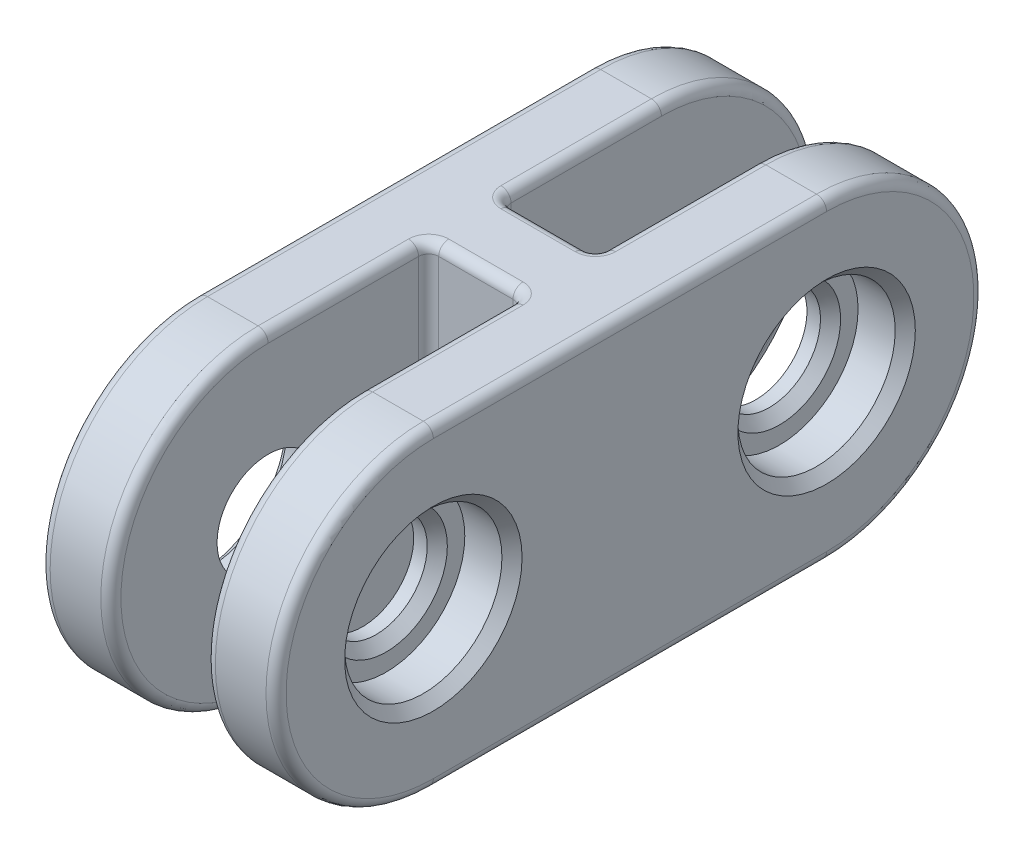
ISO-10303-21;
HEADER;
FILE_DESCRIPTION(('STEP AP214'),'2;1');
FILE_NAME('part.step','',(''),(''),'','','');
FILE_SCHEMA(('AUTOMOTIVE_DESIGN { 1 0 10303 214 1 1 1 1 }'));
ENDSEC;
DATA;
#1=APPLICATION_CONTEXT('core data for automotive mechanical design processes');
#2=APPLICATION_PROTOCOL_DEFINITION('international standard','automotive_design',2000,#1);
#3=PRODUCT_CONTEXT('',#1,'mechanical');
#4=PRODUCT('Part','Part','',(#3));
#5=PRODUCT_RELATED_PRODUCT_CATEGORY('part','',(#4));
#6=PRODUCT_DEFINITION_FORMATION('','',#4);
#7=PRODUCT_DEFINITION_CONTEXT('part definition',#1,'design');
#8=PRODUCT_DEFINITION('design','',#6,#7);
#9=PRODUCT_DEFINITION_SHAPE('','',#8);
#10=(LENGTH_UNIT() NAMED_UNIT(*) SI_UNIT(.MILLI.,.METRE.));
#11=(NAMED_UNIT(*) PLANE_ANGLE_UNIT() SI_UNIT($,.RADIAN.));
#12=(NAMED_UNIT(*) SI_UNIT($,.STERADIAN.) SOLID_ANGLE_UNIT());
#13=UNCERTAINTY_MEASURE_WITH_UNIT(LENGTH_MEASURE(1.E-05),#10,'distance_accuracy_value','');
#14=(GEOMETRIC_REPRESENTATION_CONTEXT(3) GLOBAL_UNCERTAINTY_ASSIGNED_CONTEXT((#13)) GLOBAL_UNIT_ASSIGNED_CONTEXT((#10,
#11,#12)) REPRESENTATION_CONTEXT('',''));
#15=CARTESIAN_POINT('',(0.,0.,0.));
#16=DIRECTION('',(0.,0.,1.));
#17=DIRECTION('',(1.,0.,0.));
#18=AXIS2_PLACEMENT_3D('',#15,#16,#17);
#19=CARTESIAN_POINT('',(9.525,0.,0.));
#20=DIRECTION('',(-1.,0.,0.));
#21=DIRECTION('',(0.,0.,1.));
#22=AXIS2_PLACEMENT_3D('',#19,#20,#21);
#23=CYLINDRICAL_SURFACE('',#22,4.1275);
#24=CARTESIAN_POINT('',(-4.90219999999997,0.,0.));
#25=DIRECTION('',(-1.,0.,0.));
#26=DIRECTION('',(0.,0.,1.));
#27=AXIS2_PLACEMENT_3D('',#24,#25,#26);
#28=CIRCLE('',#27,4.1275);
#29=CARTESIAN_POINT('',(-4.90219999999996,0.,4.1275));
#30=VERTEX_POINT('',#29);
#31=EDGE_CURVE('E440',#30,#30,#28,.T.);
#32=CARTESIAN_POINT('',(-3.81,0.,0.));
#33=DIRECTION('',(-1.,0.,0.));
#34=DIRECTION('',(0.,0.,1.));
#35=AXIS2_PLACEMENT_3D('',#32,#33,#34);
#36=CIRCLE('',#35,4.1275);
#37=CARTESIAN_POINT('',(-3.80999999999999,0.,4.1275));
#38=VERTEX_POINT('',#37);
#39=EDGE_CURVE('E492',#38,#38,#36,.T.);
#40=CARTESIAN_POINT('',(-4.90219999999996,0.,4.1275));
#41=CARTESIAN_POINT('',(-4.89082291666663,0.,4.1275));
#42=CARTESIAN_POINT('',(-4.8794458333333,0.,4.1275));
#43=CARTESIAN_POINT('',(-4.85669166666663,0.,4.1275));
#44=CARTESIAN_POINT('',(-4.8453145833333,0.,4.1275));
#45=CARTESIAN_POINT('',(-4.82256041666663,0.,4.1275));
#46=CARTESIAN_POINT('',(-4.8111833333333,0.,4.1275));
#47=CARTESIAN_POINT('',(-4.78842916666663,0.,4.1275));
#48=CARTESIAN_POINT('',(-4.7770520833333,0.,4.1275));
#49=CARTESIAN_POINT('',(-4.75429791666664,0.,4.1275));
#50=CARTESIAN_POINT('',(-4.7429208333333,0.,4.1275));
#51=CARTESIAN_POINT('',(-4.72016666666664,0.,4.1275));
#52=CARTESIAN_POINT('',(-4.7087895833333,0.,4.1275));
#53=CARTESIAN_POINT('',(-4.68603541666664,0.,4.1275));
#54=CARTESIAN_POINT('',(-4.6746583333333,0.,4.1275));
#55=CARTESIAN_POINT('',(-4.65190416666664,0.,4.1275));
#56=CARTESIAN_POINT('',(-4.6405270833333,0.,4.1275));
#57=CARTESIAN_POINT('',(-4.61777291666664,0.,4.1275));
#58=CARTESIAN_POINT('',(-4.60639583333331,0.,4.1275));
#59=CARTESIAN_POINT('',(-4.58364166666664,0.,4.1275));
#60=CARTESIAN_POINT('',(-4.57226458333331,0.,4.1275));
#61=CARTESIAN_POINT('',(-4.54951041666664,0.,4.1275));
#62=CARTESIAN_POINT('',(-4.53813333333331,0.,4.1275));
#63=CARTESIAN_POINT('',(-4.51537916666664,0.,4.1275));
#64=CARTESIAN_POINT('',(-4.50400208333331,0.,4.1275));
#65=CARTESIAN_POINT('',(-4.48124791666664,0.,4.1275));
#66=CARTESIAN_POINT('',(-4.46987083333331,0.,4.1275));
#67=CARTESIAN_POINT('',(-4.44711666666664,0.,4.1275));
#68=CARTESIAN_POINT('',(-4.43573958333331,0.,4.1275));
#69=CARTESIAN_POINT('',(-4.41298541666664,0.,4.1275));
#70=CARTESIAN_POINT('',(-4.40160833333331,0.,4.1275));
#71=CARTESIAN_POINT('',(-4.37885416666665,0.,4.1275));
#72=CARTESIAN_POINT('',(-4.36747708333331,0.,4.1275));
#73=CARTESIAN_POINT('',(-4.34472291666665,0.,4.1275));
#74=CARTESIAN_POINT('',(-4.33334583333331,0.,4.1275));
#75=CARTESIAN_POINT('',(-4.31059166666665,0.,4.1275));
#76=CARTESIAN_POINT('',(-4.29921458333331,0.,4.1275));
#77=CARTESIAN_POINT('',(-4.27646041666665,0.,4.1275));
#78=CARTESIAN_POINT('',(-4.26508333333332,0.,4.1275));
#79=CARTESIAN_POINT('',(-4.24232916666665,0.,4.1275));
#80=CARTESIAN_POINT('',(-4.23095208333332,0.,4.1275));
#81=CARTESIAN_POINT('',(-4.20819791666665,0.,4.1275));
#82=CARTESIAN_POINT('',(-4.19682083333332,0.,4.1275));
#83=CARTESIAN_POINT('',(-4.17406666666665,0.,4.1275));
#84=CARTESIAN_POINT('',(-4.16268958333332,0.,4.1275));
#85=CARTESIAN_POINT('',(-4.13993541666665,0.,4.1275));
#86=CARTESIAN_POINT('',(-4.12855833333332,0.,4.1275));
#87=CARTESIAN_POINT('',(-4.10580416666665,0.,4.1275));
#88=CARTESIAN_POINT('',(-4.09442708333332,0.,4.1275));
#89=CARTESIAN_POINT('',(-4.07167291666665,0.,4.1275));
#90=CARTESIAN_POINT('',(-4.06029583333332,0.,4.1275));
#91=CARTESIAN_POINT('',(-4.03754166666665,0.,4.1275));
#92=CARTESIAN_POINT('',(-4.02616458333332,0.,4.1275));
#93=CARTESIAN_POINT('',(-4.00341041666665,0.,4.1275));
#94=CARTESIAN_POINT('',(-3.99203333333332,0.,4.1275));
#95=CARTESIAN_POINT('',(-3.96927916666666,0.,4.1275));
#96=CARTESIAN_POINT('',(-3.95790208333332,0.,4.1275));
#97=CARTESIAN_POINT('',(-3.93514791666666,0.,4.1275));
#98=CARTESIAN_POINT('',(-3.92377083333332,0.,4.1275));
#99=CARTESIAN_POINT('',(-3.90101666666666,0.,4.1275));
#100=CARTESIAN_POINT('',(-3.88963958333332,0.,4.1275));
#101=CARTESIAN_POINT('',(-3.86688541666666,0.,4.1275));
#102=CARTESIAN_POINT('',(-3.85550833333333,0.,4.1275));
#103=CARTESIAN_POINT('',(-3.83275416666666,0.,4.1275));
#104=CARTESIAN_POINT('',(-3.82137708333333,0.,4.1275));
#105=CARTESIAN_POINT('',(-3.80999999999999,0.,4.1275));
#106=B_SPLINE_CURVE_WITH_KNOTS('',3,(#40,#41,#42,#43,#44,#45,#46,#47,#48,#49,#50,#51,#52,#53,
#54,#55,#56,#57,#58,#59,#60,#61,#62,#63,#64,#65,#66,#67,#68,#69,#70,#71,#72,#73,#74,#75,#76,#77,
#78,#79,#80,#81,#82,#83,#84,#85,#86,#87,#88,#89,#90,#91,#92,#93,#94,#95,#96,#97,#98,#99,#100,
#101,#102,#103,#104,#105),.UNSPECIFIED.,.F.,.F.,(4,2,2,2,2,2,2,2,2,2,2,2,2,2,2,2,2,2,2,2,2,2,2,
2,2,2,2,2,2,2,2,2,4),(0.,0.0341312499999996,0.0682624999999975,0.102393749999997,
0.136524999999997,0.170656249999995,0.204787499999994,0.238918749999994,0.273049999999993,
0.307181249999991,0.341312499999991,0.375443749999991,0.409574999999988,0.443706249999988,
0.477837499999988,0.511968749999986,0.546099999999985,0.580231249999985,0.614362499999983,
0.648493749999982,0.682624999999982,0.71675624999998,0.750887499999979,0.785018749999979,
0.819149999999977,0.853281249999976,0.887412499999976,0.921543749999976,0.955674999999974,
0.989806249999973,1.02393749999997,1.05806874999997,1.09219999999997),.UNSPECIFIED.);
#107=EDGE_CURVE('BSEAM30',#30,#38,#106,.T.);
#108=ORIENTED_EDGE('',*,*,#31,.T.);
#109=ORIENTED_EDGE('',*,*,#39,.F.);
#110=ORIENTED_EDGE('',*,*,#107,.T.);
#111=ORIENTED_EDGE('',*,*,#107,.F.);
#112=EDGE_LOOP('',(#108,#110,#109,#111));
#113=FACE_BOUND('',#112,.T.);
#114=ADVANCED_FACE('F30',(#113),#23,.F.);
#115=CARTESIAN_POINT('',(9.525,0.,0.));
#116=DIRECTION('',(-1.,0.,0.));
#117=DIRECTION('',(0.,0.,1.));
#118=AXIS2_PLACEMENT_3D('',#115,#116,#117);
#119=CYLINDRICAL_SURFACE('',#118,12.7);
#120=DIRECTION('',(-1.,0.,0.));
#121=VECTOR('',#120,1.);
#122=CARTESIAN_POINT('',(9.525,-12.7,0.));
#123=LINE('',#122,#121);
#124=CARTESIAN_POINT('',(-4.62279999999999,-12.7,0.));
#125=VERTEX_POINT('',#124);
#126=CARTESIAN_POINT('',(-8.7122,-12.7,0.));
#127=VERTEX_POINT('',#126);
#128=EDGE_CURVE('E266',#125,#127,#123,.T.);
#129=ORIENTED_EDGE('',*,*,#128,.F.);
#130=CARTESIAN_POINT('',(-4.6228,0.,0.));
#131=DIRECTION('',(-1.,0.,0.));
#132=DIRECTION('',(0.,0.,1.));
#133=AXIS2_PLACEMENT_3D('',#130,#131,#132);
#134=CIRCLE('',#133,12.7);
#135=CARTESIAN_POINT('',(-4.62279999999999,12.7,0.));
#136=VERTEX_POINT('',#135);
#137=EDGE_CURVE('E252',#125,#136,#134,.T.);
#138=ORIENTED_EDGE('',*,*,#137,.T.);
#139=DIRECTION('',(-1.,0.,0.));
#140=VECTOR('',#139,1.);
#141=CARTESIAN_POINT('',(9.525,12.7,0.));
#142=LINE('',#141,#140);
#143=CARTESIAN_POINT('',(-8.7122,12.7,0.));
#144=VERTEX_POINT('',#143);
#145=EDGE_CURVE('E280',#136,#144,#142,.T.);
#146=ORIENTED_EDGE('',*,*,#145,.T.);
#147=CARTESIAN_POINT('',(-8.7122,0.,0.));
#148=DIRECTION('',(1.,0.,0.));
#149=DIRECTION('',(0.,0.,-1.));
#150=AXIS2_PLACEMENT_3D('',#147,#148,#149);
#151=CIRCLE('',#150,12.7);
#152=EDGE_CURVE('E261',#144,#127,#151,.T.);
#153=ORIENTED_EDGE('',*,*,#152,.T.);
#154=EDGE_LOOP('',(#129,#138,#146,#153));
#155=FACE_BOUND('',#154,.T.);
#156=ADVANCED_FACE('F274',(#155),#119,.T.);
#157=CARTESIAN_POINT('',(9.525,0.,-31.75));
#158=DIRECTION('',(-1.,0.,0.));
#159=DIRECTION('',(0.,0.,1.));
#160=AXIS2_PLACEMENT_3D('',#157,#158,#159);
#161=CYLINDRICAL_SURFACE('',#160,4.1275);
#162=CARTESIAN_POINT('',(-4.90219999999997,0.,-31.75));
#163=DIRECTION('',(-1.,0.,0.));
#164=DIRECTION('',(0.,0.,1.));
#165=AXIS2_PLACEMENT_3D('',#162,#163,#164);
#166=CIRCLE('',#165,4.1275);
#167=CARTESIAN_POINT('',(-4.90219999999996,0.,-27.6225));
#168=VERTEX_POINT('',#167);
#169=EDGE_CURVE('E425',#168,#168,#166,.T.);
#170=CARTESIAN_POINT('',(-3.81,0.,-31.75));
#171=DIRECTION('',(-1.,0.,0.));
#172=DIRECTION('',(0.,0.,1.));
#173=AXIS2_PLACEMENT_3D('',#170,#171,#172);
#174=CIRCLE('',#173,4.1275);
#175=CARTESIAN_POINT('',(-3.81,0.,-27.6225));
#176=VERTEX_POINT('',#175);
#177=EDGE_CURVE('E491',#176,#176,#174,.T.);
#178=CARTESIAN_POINT('',(-4.90219999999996,0.,-27.6225));
#179=CARTESIAN_POINT('',(-4.89082291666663,0.,-27.6225));
#180=CARTESIAN_POINT('',(-4.8794458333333,0.,-27.6225));
#181=CARTESIAN_POINT('',(-4.85669166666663,0.,-27.6225));
#182=CARTESIAN_POINT('',(-4.8453145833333,0.,-27.6225));
#183=CARTESIAN_POINT('',(-4.82256041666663,0.,-27.6225));
#184=CARTESIAN_POINT('',(-4.8111833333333,0.,-27.6225));
#185=CARTESIAN_POINT('',(-4.78842916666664,0.,-27.6225));
#186=CARTESIAN_POINT('',(-4.7770520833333,0.,-27.6225));
#187=CARTESIAN_POINT('',(-4.75429791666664,0.,-27.6225));
#188=CARTESIAN_POINT('',(-4.7429208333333,0.,-27.6225));
#189=CARTESIAN_POINT('',(-4.72016666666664,0.,-27.6225));
#190=CARTESIAN_POINT('',(-4.7087895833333,0.,-27.6225));
#191=CARTESIAN_POINT('',(-4.68603541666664,0.,-27.6225));
#192=CARTESIAN_POINT('',(-4.67465833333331,0.,-27.6225));
#193=CARTESIAN_POINT('',(-4.65190416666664,0.,-27.6225));
#194=CARTESIAN_POINT('',(-4.64052708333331,0.,-27.6225));
#195=CARTESIAN_POINT('',(-4.61777291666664,0.,-27.6225));
#196=CARTESIAN_POINT('',(-4.60639583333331,0.,-27.6225));
#197=CARTESIAN_POINT('',(-4.58364166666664,0.,-27.6225));
#198=CARTESIAN_POINT('',(-4.57226458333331,0.,-27.6225));
#199=CARTESIAN_POINT('',(-4.54951041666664,0.,-27.6225));
#200=CARTESIAN_POINT('',(-4.53813333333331,0.,-27.6225));
#201=CARTESIAN_POINT('',(-4.51537916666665,0.,-27.6225));
#202=CARTESIAN_POINT('',(-4.50400208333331,0.,-27.6225));
#203=CARTESIAN_POINT('',(-4.48124791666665,0.,-27.6225));
#204=CARTESIAN_POINT('',(-4.46987083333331,0.,-27.6225));
#205=CARTESIAN_POINT('',(-4.44711666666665,0.,-27.6225));
#206=CARTESIAN_POINT('',(-4.43573958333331,0.,-27.6225));
#207=CARTESIAN_POINT('',(-4.41298541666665,0.,-27.6225));
#208=CARTESIAN_POINT('',(-4.40160833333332,0.,-27.6225));
#209=CARTESIAN_POINT('',(-4.37885416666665,0.,-27.6225));
#210=CARTESIAN_POINT('',(-4.36747708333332,0.,-27.6225));
#211=CARTESIAN_POINT('',(-4.34472291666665,0.,-27.6225));
#212=CARTESIAN_POINT('',(-4.33334583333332,0.,-27.6225));
#213=CARTESIAN_POINT('',(-4.31059166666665,0.,-27.6225));
#214=CARTESIAN_POINT('',(-4.29921458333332,0.,-27.6225));
#215=CARTESIAN_POINT('',(-4.27646041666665,0.,-27.6225));
#216=CARTESIAN_POINT('',(-4.26508333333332,0.,-27.6225));
#217=CARTESIAN_POINT('',(-4.24232916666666,0.,-27.6225));
#218=CARTESIAN_POINT('',(-4.23095208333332,0.,-27.6225));
#219=CARTESIAN_POINT('',(-4.20819791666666,0.,-27.6225));
#220=CARTESIAN_POINT('',(-4.19682083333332,0.,-27.6225));
#221=CARTESIAN_POINT('',(-4.17406666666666,0.,-27.6225));
#222=CARTESIAN_POINT('',(-4.16268958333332,0.,-27.6225));
#223=CARTESIAN_POINT('',(-4.13993541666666,0.,-27.6225));
#224=CARTESIAN_POINT('',(-4.12855833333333,0.,-27.6225));
#225=CARTESIAN_POINT('',(-4.10580416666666,0.,-27.6225));
#226=CARTESIAN_POINT('',(-4.09442708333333,0.,-27.6225));
#227=CARTESIAN_POINT('',(-4.07167291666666,0.,-27.6225));
#228=CARTESIAN_POINT('',(-4.06029583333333,0.,-27.6225));
#229=CARTESIAN_POINT('',(-4.03754166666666,0.,-27.6225));
#230=CARTESIAN_POINT('',(-4.02616458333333,0.,-27.6225));
#231=CARTESIAN_POINT('',(-4.00341041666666,0.,-27.6225));
#232=CARTESIAN_POINT('',(-3.99203333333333,0.,-27.6225));
#233=CARTESIAN_POINT('',(-3.96927916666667,0.,-27.6225));
#234=CARTESIAN_POINT('',(-3.95790208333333,0.,-27.6225));
#235=CARTESIAN_POINT('',(-3.93514791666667,0.,-27.6225));
#236=CARTESIAN_POINT('',(-3.92377083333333,0.,-27.6225));
#237=CARTESIAN_POINT('',(-3.90101666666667,0.,-27.6225));
#238=CARTESIAN_POINT('',(-3.88963958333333,0.,-27.6225));
#239=CARTESIAN_POINT('',(-3.86688541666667,0.,-27.6225));
#240=CARTESIAN_POINT('',(-3.85550833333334,0.,-27.6225));
#241=CARTESIAN_POINT('',(-3.83275416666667,0.,-27.6225));
#242=CARTESIAN_POINT('',(-3.82137708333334,0.,-27.6225));
#243=CARTESIAN_POINT('',(-3.81,0.,-27.6225));
#244=B_SPLINE_CURVE_WITH_KNOTS('',3,(#178,#179,#180,#181,#182,#183,#184,#185,#186,#187,#188,
#189,#190,#191,#192,#193,#194,#195,#196,#197,#198,#199,#200,#201,#202,#203,#204,#205,#206,#207,
#208,#209,#210,#211,#212,#213,#214,#215,#216,#217,#218,#219,#220,#221,#222,#223,#224,#225,#226,
#227,#228,#229,#230,#231,#232,#233,#234,#235,#236,#237,#238,#239,#240,#241,#242,#243),
.UNSPECIFIED.,.F.,.F.,(4,2,2,2,2,2,2,2,2,2,2,2,2,2,2,2,2,2,2,2,2,2,2,2,2,2,2,2,2,2,2,2,4),(0.,
0.0341312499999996,0.0682624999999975,0.102393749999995,0.136524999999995,0.170656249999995,
0.204787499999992,0.23891874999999,0.27304999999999,0.30718124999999,0.341312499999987,
0.375443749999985,0.409574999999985,0.443706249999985,0.477837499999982,0.51196874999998,
0.54609999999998,0.58023124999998,0.614362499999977,0.648493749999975,0.682624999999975,
0.716756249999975,0.750887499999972,0.78501874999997,0.81914999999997,0.85328124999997,
0.887412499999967,0.921543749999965,0.955674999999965,0.989806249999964,1.02393749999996,
1.05806874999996,1.09219999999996),.UNSPECIFIED.);
#245=EDGE_CURVE('BSEAM486',#168,#176,#244,.T.);
#246=ORIENTED_EDGE('',*,*,#169,.T.);
#247=ORIENTED_EDGE('',*,*,#177,.F.);
#248=ORIENTED_EDGE('',*,*,#245,.T.);
#249=ORIENTED_EDGE('',*,*,#245,.F.);
#250=EDGE_LOOP('',(#246,#248,#247,#249));
#251=FACE_BOUND('',#250,.T.);
#252=ADVANCED_FACE('F486',(#251),#161,.F.);
#253=CARTESIAN_POINT('',(9.525,0.,-31.75));
#254=DIRECTION('',(-1.,0.,0.));
#255=DIRECTION('',(0.,0.,1.));
#256=AXIS2_PLACEMENT_3D('',#253,#254,#255);
#257=CYLINDRICAL_SURFACE('',#256,12.7);
#258=DIRECTION('',(-1.,0.,0.));
#259=VECTOR('',#258,1.);
#260=CARTESIAN_POINT('',(9.525,12.7,-31.75));
#261=LINE('',#260,#259);
#262=CARTESIAN_POINT('',(-4.6228,12.7,-31.75));
#263=VERTEX_POINT('',#262);
#264=CARTESIAN_POINT('',(-8.7122,12.7,-31.75));
#265=VERTEX_POINT('',#264);
#266=EDGE_CURVE('E289',#263,#265,#261,.T.);
#267=ORIENTED_EDGE('',*,*,#266,.F.);
#268=CARTESIAN_POINT('',(-4.6228,0.,-31.75));
#269=DIRECTION('',(-1.,0.,0.));
#270=DIRECTION('',(0.,0.,1.));
#271=AXIS2_PLACEMENT_3D('',#268,#269,#270);
#272=CIRCLE('',#271,12.7);
#273=CARTESIAN_POINT('',(-4.6228,-12.7,-31.75));
#274=VERTEX_POINT('',#273);
#275=EDGE_CURVE('E340',#263,#274,#272,.T.);
#276=ORIENTED_EDGE('',*,*,#275,.T.);
#277=DIRECTION('',(-1.,0.,0.));
#278=VECTOR('',#277,1.);
#279=CARTESIAN_POINT('',(9.525,-12.7,-31.75));
#280=LINE('',#279,#278);
#281=CARTESIAN_POINT('',(-8.7122,-12.7,-31.75));
#282=VERTEX_POINT('',#281);
#283=EDGE_CURVE('E282',#274,#282,#280,.T.);
#284=ORIENTED_EDGE('',*,*,#283,.T.);
#285=CARTESIAN_POINT('',(-8.7122,0.,-31.75));
#286=DIRECTION('',(1.,0.,0.));
#287=DIRECTION('',(0.,0.,-1.));
#288=AXIS2_PLACEMENT_3D('',#285,#286,#287);
#289=CIRCLE('',#288,12.7);
#290=EDGE_CURVE('E338',#282,#265,#289,.T.);
#291=ORIENTED_EDGE('',*,*,#290,.T.);
#292=EDGE_LOOP('',(#267,#276,#284,#291));
#293=FACE_BOUND('',#292,.T.);
#294=ADVANCED_FACE('F517',(#293),#257,.T.);
#295=CARTESIAN_POINT('',(-9.525,0.,-31.75));
#296=DIRECTION('',(1.,0.,0.));
#297=DIRECTION('',(0.,0.,-1.));
#298=AXIS2_PLACEMENT_3D('',#295,#296,#297);
#299=PLANE('',#298);
#300=CARTESIAN_POINT('',(-9.525,0.,-31.75));
#301=DIRECTION('',(1.,0.,0.));
#302=DIRECTION('',(0.,0.,-1.));
#303=AXIS2_PLACEMENT_3D('',#300,#301,#302);
#304=CIRCLE('',#303,7.16279999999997);
#305=CARTESIAN_POINT('',(-9.525,0.,-38.9128));
#306=VERTEX_POINT('',#305);
#307=EDGE_CURVE('E434',#306,#306,#304,.T.);
#308=ORIENTED_EDGE('',*,*,#307,.T.);
#309=EDGE_LOOP('',(#308));
#310=FACE_BOUND('',#309,.T.);
#311=CARTESIAN_POINT('',(-9.525,0.,0.));
#312=DIRECTION('',(1.,0.,0.));
#313=DIRECTION('',(0.,0.,-1.));
#314=AXIS2_PLACEMENT_3D('',#311,#312,#313);
#315=CIRCLE('',#314,7.16279999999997);
#316=CARTESIAN_POINT('',(-9.525,0.,-7.16279999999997));
#317=VERTEX_POINT('',#316);
#318=EDGE_CURVE('E431',#317,#317,#315,.T.);
#319=ORIENTED_EDGE('',*,*,#318,.T.);
#320=EDGE_LOOP('',(#319));
#321=FACE_BOUND('',#320,.T.);
#322=CARTESIAN_POINT('',(-9.525,0.,0.));
#323=DIRECTION('',(1.,0.,0.));
#324=DIRECTION('',(0.,0.,-1.));
#325=AXIS2_PLACEMENT_3D('',#322,#323,#324);
#326=CIRCLE('',#325,11.8872);
#327=CARTESIAN_POINT('',(-9.525,-11.8872,0.));
#328=VERTEX_POINT('',#327);
#329=CARTESIAN_POINT('',(-9.525,11.8872,0.));
#330=VERTEX_POINT('',#329);
#331=EDGE_CURVE('E388',#328,#330,#326,.F.);
#332=ORIENTED_EDGE('',*,*,#331,.T.);
#333=DIRECTION('',(0.,0.,1.));
#334=VECTOR('',#333,1.);
#335=CARTESIAN_POINT('',(-9.525,11.8872,-31.75));
#336=LINE('',#335,#334);
#337=CARTESIAN_POINT('',(-9.525,11.8872,-31.75));
#338=VERTEX_POINT('',#337);
#339=EDGE_CURVE('E394',#330,#338,#336,.F.);
#340=ORIENTED_EDGE('',*,*,#339,.T.);
#341=CARTESIAN_POINT('',(-9.525,0.,-31.75));
#342=DIRECTION('',(1.,0.,0.));
#343=DIRECTION('',(0.,0.,-1.));
#344=AXIS2_PLACEMENT_3D('',#341,#342,#343);
#345=CIRCLE('',#344,11.8872);
#346=CARTESIAN_POINT('',(-9.525,-11.8872,-31.75));
#347=VERTEX_POINT('',#346);
#348=EDGE_CURVE('E392',#338,#347,#345,.F.);
#349=ORIENTED_EDGE('',*,*,#348,.T.);
#350=DIRECTION('',(0.,0.,-1.));
#351=VECTOR('',#350,1.);
#352=CARTESIAN_POINT('',(-9.525,-11.8872,-31.75));
#353=LINE('',#352,#351);
#354=EDGE_CURVE('E390',#347,#328,#353,.F.);
#355=ORIENTED_EDGE('',*,*,#354,.T.);
#356=EDGE_LOOP('',(#332,#340,#349,#355));
#357=FACE_BOUND('',#356,.T.);
#358=ADVANCED_FACE('F699',(#310,#321,#357),#299,.F.);
#359=CARTESIAN_POINT('',(4.90219999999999,0.,0.));
#360=DIRECTION('',(1.,0.,0.));
#361=DIRECTION('',(0.,0.,-1.));
#362=AXIS2_PLACEMENT_3D('',#359,#360,#361);
#363=CIRCLE('',#362,4.1275);
#364=CARTESIAN_POINT('',(4.90219999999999,0.,4.1275));
#365=VERTEX_POINT('',#364);
#366=EDGE_CURVE('E449',#365,#365,#363,.T.);
#367=CARTESIAN_POINT('',(3.81,0.,0.));
#368=DIRECTION('',(1.,0.,0.));
#369=DIRECTION('',(0.,0.,-1.));
#370=AXIS2_PLACEMENT_3D('',#367,#368,#369);
#371=CIRCLE('',#370,4.1275);
#372=CARTESIAN_POINT('',(3.81,0.,4.1275));
#373=VERTEX_POINT('',#372);
#374=EDGE_CURVE('E498',#373,#373,#371,.T.);
#375=CARTESIAN_POINT('',(4.90219999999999,0.,4.1275));
#376=CARTESIAN_POINT('',(4.89082291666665,0.,4.1275));
#377=CARTESIAN_POINT('',(4.87944583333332,0.,4.1275));
#378=CARTESIAN_POINT('',(4.85669166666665,0.,4.1275));
#379=CARTESIAN_POINT('',(4.84531458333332,0.,4.1275));
#380=CARTESIAN_POINT('',(4.82256041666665,0.,4.1275));
#381=CARTESIAN_POINT('',(4.81118333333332,0.,4.1275));
#382=CARTESIAN_POINT('',(4.78842916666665,0.,4.1275));
#383=CARTESIAN_POINT('',(4.77705208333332,0.,4.1275));
#384=CARTESIAN_POINT('',(4.75429791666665,0.,4.1275));
#385=CARTESIAN_POINT('',(4.74292083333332,0.,4.1275));
#386=CARTESIAN_POINT('',(4.72016666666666,0.,4.1275));
#387=CARTESIAN_POINT('',(4.70878958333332,0.,4.1275));
#388=CARTESIAN_POINT('',(4.68603541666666,0.,4.1275));
#389=CARTESIAN_POINT('',(4.67465833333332,0.,4.1275));
#390=CARTESIAN_POINT('',(4.65190416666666,0.,4.1275));
#391=CARTESIAN_POINT('',(4.64052708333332,0.,4.1275));
#392=CARTESIAN_POINT('',(4.61777291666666,0.,4.1275));
#393=CARTESIAN_POINT('',(4.60639583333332,0.,4.1275));
#394=CARTESIAN_POINT('',(4.58364166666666,0.,4.1275));
#395=CARTESIAN_POINT('',(4.57226458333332,0.,4.1275));
#396=CARTESIAN_POINT('',(4.54951041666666,0.,4.1275));
#397=CARTESIAN_POINT('',(4.53813333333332,0.,4.1275));
#398=CARTESIAN_POINT('',(4.51537916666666,0.,4.1275));
#399=CARTESIAN_POINT('',(4.50400208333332,0.,4.1275));
#400=CARTESIAN_POINT('',(4.48124791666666,0.,4.1275));
#401=CARTESIAN_POINT('',(4.46987083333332,0.,4.1275));
#402=CARTESIAN_POINT('',(4.44711666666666,0.,4.1275));
#403=CARTESIAN_POINT('',(4.43573958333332,0.,4.1275));
#404=CARTESIAN_POINT('',(4.41298541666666,0.,4.1275));
#405=CARTESIAN_POINT('',(4.40160833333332,0.,4.1275));
#406=CARTESIAN_POINT('',(4.37885416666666,0.,4.1275));
#407=CARTESIAN_POINT('',(4.36747708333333,0.,4.1275));
#408=CARTESIAN_POINT('',(4.34472291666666,0.,4.1275));
#409=CARTESIAN_POINT('',(4.33334583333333,0.,4.1275));
#410=CARTESIAN_POINT('',(4.31059166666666,0.,4.1275));
#411=CARTESIAN_POINT('',(4.29921458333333,0.,4.1275));
#412=CARTESIAN_POINT('',(4.27646041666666,0.,4.1275));
#413=CARTESIAN_POINT('',(4.26508333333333,0.,4.1275));
#414=CARTESIAN_POINT('',(4.24232916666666,0.,4.1275));
#415=CARTESIAN_POINT('',(4.23095208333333,0.,4.1275));
#416=CARTESIAN_POINT('',(4.20819791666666,0.,4.1275));
#417=CARTESIAN_POINT('',(4.19682083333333,0.,4.1275));
#418=CARTESIAN_POINT('',(4.17406666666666,0.,4.1275));
#419=CARTESIAN_POINT('',(4.16268958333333,0.,4.1275));
#420=CARTESIAN_POINT('',(4.13993541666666,0.,4.1275));
#421=CARTESIAN_POINT('',(4.12855833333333,0.,4.1275));
#422=CARTESIAN_POINT('',(4.10580416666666,0.,4.1275));
#423=CARTESIAN_POINT('',(4.09442708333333,0.,4.1275));
#424=CARTESIAN_POINT('',(4.07167291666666,0.,4.1275));
#425=CARTESIAN_POINT('',(4.06029583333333,0.,4.1275));
#426=CARTESIAN_POINT('',(4.03754166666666,0.,4.1275));
#427=CARTESIAN_POINT('',(4.02616458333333,0.,4.1275));
#428=CARTESIAN_POINT('',(4.00341041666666,0.,4.1275));
#429=CARTESIAN_POINT('',(3.99203333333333,0.,4.1275));
#430=CARTESIAN_POINT('',(3.96927916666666,0.,4.1275));
#431=CARTESIAN_POINT('',(3.95790208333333,0.,4.1275));
#432=CARTESIAN_POINT('',(3.93514791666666,0.,4.1275));
#433=CARTESIAN_POINT('',(3.92377083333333,0.,4.1275));
#434=CARTESIAN_POINT('',(3.90101666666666,0.,4.1275));
#435=CARTESIAN_POINT('',(3.88963958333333,0.,4.1275));
#436=CARTESIAN_POINT('',(3.86688541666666,0.,4.1275));
#437=CARTESIAN_POINT('',(3.85550833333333,0.,4.1275));
#438=CARTESIAN_POINT('',(3.83275416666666,0.,4.1275));
#439=CARTESIAN_POINT('',(3.82137708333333,0.,4.1275));
#440=CARTESIAN_POINT('',(3.81,0.,4.1275));
#441=B_SPLINE_CURVE_WITH_KNOTS('',3,(#375,#376,#377,#378,#379,#380,#381,#382,#383,#384,#385,
#386,#387,#388,#389,#390,#391,#392,#393,#394,#395,#396,#397,#398,#399,#400,#401,#402,#403,#404,
#405,#406,#407,#408,#409,#410,#411,#412,#413,#414,#415,#416,#417,#418,#419,#420,#421,#422,#423,
#424,#425,#426,#427,#428,#429,#430,#431,#432,#433,#434,#435,#436,#437,#438,#439,#440),
.UNSPECIFIED.,.F.,.F.,(4,2,2,2,2,2,2,2,2,2,2,2,2,2,2,2,2,2,2,2,2,2,2,2,2,2,2,2,2,2,2,2,4),(0.,
0.0341312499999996,0.0682624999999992,0.102393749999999,0.136524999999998,0.170656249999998,
0.204787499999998,0.238918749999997,0.273049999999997,0.307181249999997,0.341312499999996,
0.375443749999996,0.409574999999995,0.443706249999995,0.477837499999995,0.511968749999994,
0.546099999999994,0.580231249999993,0.614362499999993,0.648493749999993,0.682624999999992,
0.716756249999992,0.750887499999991,0.785018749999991,0.819149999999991,0.85328124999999,
0.88741249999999,0.92154374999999,0.955674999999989,0.989806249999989,1.02393749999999,
1.05806874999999,1.09219999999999),.UNSPECIFIED.);
#442=EDGE_CURVE('BSEAM484',#365,#373,#441,.T.);
#443=ORIENTED_EDGE('',*,*,#366,.T.);
#444=ORIENTED_EDGE('',*,*,#374,.F.);
#445=ORIENTED_EDGE('',*,*,#442,.T.);
#446=ORIENTED_EDGE('',*,*,#442,.F.);
#447=EDGE_LOOP('',(#443,#445,#444,#446));
#448=FACE_BOUND('',#447,.T.);
#449=ADVANCED_FACE('F484',(#448),#23,.F.);
#450=CARTESIAN_POINT('',(4.90219999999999,0.,-31.75));
#451=DIRECTION('',(1.,0.,0.));
#452=DIRECTION('',(0.,0.,-1.));
#453=AXIS2_PLACEMENT_3D('',#450,#451,#452);
#454=CIRCLE('',#453,4.1275);
#455=CARTESIAN_POINT('',(4.90219999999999,0.,-27.6225));
#456=VERTEX_POINT('',#455);
#457=EDGE_CURVE('E464',#456,#456,#454,.T.);
#458=CARTESIAN_POINT('',(3.81,0.,-31.75));
#459=DIRECTION('',(1.,0.,0.));
#460=DIRECTION('',(0.,0.,-1.));
#461=AXIS2_PLACEMENT_3D('',#458,#459,#460);
#462=CIRCLE('',#461,4.1275);
#463=CARTESIAN_POINT('',(3.81,0.,-27.6225));
#464=VERTEX_POINT('',#463);
#465=EDGE_CURVE('E489',#464,#464,#462,.T.);
#466=CARTESIAN_POINT('',(4.90219999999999,0.,-27.6225));
#467=CARTESIAN_POINT('',(4.89082291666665,0.,-27.6225));
#468=CARTESIAN_POINT('',(4.87944583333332,0.,-27.6225));
#469=CARTESIAN_POINT('',(4.85669166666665,0.,-27.6225));
#470=CARTESIAN_POINT('',(4.84531458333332,0.,-27.6225));
#471=CARTESIAN_POINT('',(4.82256041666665,0.,-27.6225));
#472=CARTESIAN_POINT('',(4.81118333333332,0.,-27.6225));
#473=CARTESIAN_POINT('',(4.78842916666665,0.,-27.6225));
#474=CARTESIAN_POINT('',(4.77705208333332,0.,-27.6225));
#475=CARTESIAN_POINT('',(4.75429791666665,0.,-27.6225));
#476=CARTESIAN_POINT('',(4.74292083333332,0.,-27.6225));
#477=CARTESIAN_POINT('',(4.72016666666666,0.,-27.6225));
#478=CARTESIAN_POINT('',(4.70878958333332,0.,-27.6225));
#479=CARTESIAN_POINT('',(4.68603541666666,0.,-27.6225));
#480=CARTESIAN_POINT('',(4.67465833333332,0.,-27.6225));
#481=CARTESIAN_POINT('',(4.65190416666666,0.,-27.6225));
#482=CARTESIAN_POINT('',(4.64052708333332,0.,-27.6225));
#483=CARTESIAN_POINT('',(4.61777291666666,0.,-27.6225));
#484=CARTESIAN_POINT('',(4.60639583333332,0.,-27.6225));
#485=CARTESIAN_POINT('',(4.58364166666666,0.,-27.6225));
#486=CARTESIAN_POINT('',(4.57226458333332,0.,-27.6225));
#487=CARTESIAN_POINT('',(4.54951041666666,0.,-27.6225));
#488=CARTESIAN_POINT('',(4.53813333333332,0.,-27.6225));
#489=CARTESIAN_POINT('',(4.51537916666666,0.,-27.6225));
#490=CARTESIAN_POINT('',(4.50400208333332,0.,-27.6225));
#491=CARTESIAN_POINT('',(4.48124791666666,0.,-27.6225));
#492=CARTESIAN_POINT('',(4.46987083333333,0.,-27.6225));
#493=CARTESIAN_POINT('',(4.44711666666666,0.,-27.6225));
#494=CARTESIAN_POINT('',(4.43573958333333,0.,-27.6225));
#495=CARTESIAN_POINT('',(4.41298541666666,0.,-27.6225));
#496=CARTESIAN_POINT('',(4.40160833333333,0.,-27.6225));
#497=CARTESIAN_POINT('',(4.37885416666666,0.,-27.6225));
#498=CARTESIAN_POINT('',(4.36747708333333,0.,-27.6225));
#499=CARTESIAN_POINT('',(4.34472291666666,0.,-27.6225));
#500=CARTESIAN_POINT('',(4.33334583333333,0.,-27.6225));
#501=CARTESIAN_POINT('',(4.31059166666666,0.,-27.6225));
#502=CARTESIAN_POINT('',(4.29921458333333,0.,-27.6225));
#503=CARTESIAN_POINT('',(4.27646041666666,0.,-27.6225));
#504=CARTESIAN_POINT('',(4.26508333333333,0.,-27.6225));
#505=CARTESIAN_POINT('',(4.24232916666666,0.,-27.6225));
#506=CARTESIAN_POINT('',(4.23095208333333,0.,-27.6225));
#507=CARTESIAN_POINT('',(4.20819791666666,0.,-27.6225));
#508=CARTESIAN_POINT('',(4.19682083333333,0.,-27.6225));
#509=CARTESIAN_POINT('',(4.17406666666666,0.,-27.6225));
#510=CARTESIAN_POINT('',(4.16268958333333,0.,-27.6225));
#511=CARTESIAN_POINT('',(4.13993541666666,0.,-27.6225));
#512=CARTESIAN_POINT('',(4.12855833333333,0.,-27.6225));
#513=CARTESIAN_POINT('',(4.10580416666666,0.,-27.6225));
#514=CARTESIAN_POINT('',(4.09442708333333,0.,-27.6225));
#515=CARTESIAN_POINT('',(4.07167291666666,0.,-27.6225));
#516=CARTESIAN_POINT('',(4.06029583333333,0.,-27.6225));
#517=CARTESIAN_POINT('',(4.03754166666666,0.,-27.6225));
#518=CARTESIAN_POINT('',(4.02616458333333,0.,-27.6225));
#519=CARTESIAN_POINT('',(4.00341041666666,0.,-27.6225));
#520=CARTESIAN_POINT('',(3.99203333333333,0.,-27.6225));
#521=CARTESIAN_POINT('',(3.96927916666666,0.,-27.6225));
#522=CARTESIAN_POINT('',(3.95790208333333,0.,-27.6225));
#523=CARTESIAN_POINT('',(3.93514791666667,0.,-27.6225));
#524=CARTESIAN_POINT('',(3.92377083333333,0.,-27.6225));
#525=CARTESIAN_POINT('',(3.90101666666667,0.,-27.6225));
#526=CARTESIAN_POINT('',(3.88963958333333,0.,-27.6225));
#527=CARTESIAN_POINT('',(3.86688541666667,0.,-27.6225));
#528=CARTESIAN_POINT('',(3.85550833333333,0.,-27.6225));
#529=CARTESIAN_POINT('',(3.83275416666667,0.,-27.6225));
#530=CARTESIAN_POINT('',(3.82137708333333,0.,-27.6225));
#531=CARTESIAN_POINT('',(3.81,0.,-27.6225));
#532=B_SPLINE_CURVE_WITH_KNOTS('',3,(#466,#467,#468,#469,#470,#471,#472,#473,#474,#475,#476,
#477,#478,#479,#480,#481,#482,#483,#484,#485,#486,#487,#488,#489,#490,#491,#492,#493,#494,#495,
#496,#497,#498,#499,#500,#501,#502,#503,#504,#505,#506,#507,#508,#509,#510,#511,#512,#513,#514,
#515,#516,#517,#518,#519,#520,#521,#522,#523,#524,#525,#526,#527,#528,#529,#530,#531),
.UNSPECIFIED.,.F.,.F.,(4,2,2,2,2,2,2,2,2,2,2,2,2,2,2,2,2,2,2,2,2,2,2,2,2,2,2,2,2,2,2,2,4),(0.,
0.0341312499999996,0.0682624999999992,0.102393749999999,0.136524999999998,0.170656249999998,
0.204787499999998,0.238918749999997,0.273049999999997,0.307181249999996,0.341312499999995,
0.375443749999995,0.409574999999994,0.443706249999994,0.477837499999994,0.511968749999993,
0.546099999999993,0.580231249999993,0.614362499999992,0.648493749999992,0.682624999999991,
0.716756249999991,0.750887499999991,0.785018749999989,0.819149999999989,0.853281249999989,
0.887412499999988,0.921543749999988,0.955674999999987,0.989806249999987,1.02393749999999,
1.05806874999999,1.09219999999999),.UNSPECIFIED.);
#533=EDGE_CURVE('BSEAM480',#456,#464,#532,.T.);
#534=ORIENTED_EDGE('',*,*,#457,.T.);
#535=ORIENTED_EDGE('',*,*,#465,.F.);
#536=ORIENTED_EDGE('',*,*,#533,.T.);
#537=ORIENTED_EDGE('',*,*,#533,.F.);
#538=EDGE_LOOP('',(#534,#536,#535,#537));
#539=FACE_BOUND('',#538,.T.);
#540=ADVANCED_FACE('F480',(#539),#161,.F.);
#541=CARTESIAN_POINT('',(9.525,0.,-31.75));
#542=DIRECTION('',(1.,0.,0.));
#543=DIRECTION('',(0.,0.,-1.));
#544=AXIS2_PLACEMENT_3D('',#541,#542,#543);
#545=PLANE('',#544);
#546=CARTESIAN_POINT('',(9.525,0.,0.));
#547=DIRECTION('',(1.,0.,0.));
#548=DIRECTION('',(0.,0.,-1.));
#549=AXIS2_PLACEMENT_3D('',#546,#547,#548);
#550=CIRCLE('',#549,7.16280000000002);
#551=CARTESIAN_POINT('',(9.525,0.,-7.16280000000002));
#552=VERTEX_POINT('',#551);
#553=EDGE_CURVE('E461',#552,#552,#550,.F.);
#554=ORIENTED_EDGE('',*,*,#553,.T.);
#555=EDGE_LOOP('',(#554));
#556=FACE_BOUND('',#555,.T.);
#557=CARTESIAN_POINT('',(9.525,0.,-31.75));
#558=DIRECTION('',(1.,0.,0.));
#559=DIRECTION('',(0.,0.,-1.));
#560=AXIS2_PLACEMENT_3D('',#557,#558,#559);
#561=CIRCLE('',#560,7.16280000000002);
#562=CARTESIAN_POINT('',(9.525,0.,-38.9128));
#563=VERTEX_POINT('',#562);
#564=EDGE_CURVE('E458',#563,#563,#561,.F.);
#565=ORIENTED_EDGE('',*,*,#564,.T.);
#566=EDGE_LOOP('',(#565));
#567=FACE_BOUND('',#566,.T.);
#568=CARTESIAN_POINT('',(9.525,0.,-31.75));
#569=DIRECTION('',(1.,0.,0.));
#570=DIRECTION('',(0.,0.,-1.));
#571=AXIS2_PLACEMENT_3D('',#568,#569,#570);
#572=CIRCLE('',#571,11.8872);
#573=CARTESIAN_POINT('',(9.525,-11.8872,-31.75));
#574=VERTEX_POINT('',#573);
#575=CARTESIAN_POINT('',(9.525,11.8872,-31.75));
#576=VERTEX_POINT('',#575);
#577=EDGE_CURVE('E401',#574,#576,#572,.T.);
#578=ORIENTED_EDGE('',*,*,#577,.T.);
#579=DIRECTION('',(0.,0.,1.));
#580=VECTOR('',#579,1.);
#581=CARTESIAN_POINT('',(9.525,11.8872,0.));
#582=LINE('',#581,#580);
#583=CARTESIAN_POINT('',(9.525,11.8872,0.));
#584=VERTEX_POINT('',#583);
#585=EDGE_CURVE('E403',#576,#584,#582,.T.);
#586=ORIENTED_EDGE('',*,*,#585,.T.);
#587=CARTESIAN_POINT('',(9.525,0.,0.));
#588=DIRECTION('',(1.,0.,0.));
#589=DIRECTION('',(0.,0.,-1.));
#590=AXIS2_PLACEMENT_3D('',#587,#588,#589);
#591=CIRCLE('',#590,11.8872);
#592=CARTESIAN_POINT('',(9.525,-11.8872,0.));
#593=VERTEX_POINT('',#592);
#594=EDGE_CURVE('E397',#584,#593,#591,.T.);
#595=ORIENTED_EDGE('',*,*,#594,.T.);
#596=DIRECTION('',(0.,0.,-1.));
#597=VECTOR('',#596,1.);
#598=CARTESIAN_POINT('',(9.525,-11.8872,-31.75));
#599=LINE('',#598,#597);
#600=EDGE_CURVE('E399',#593,#574,#599,.T.);
#601=ORIENTED_EDGE('',*,*,#600,.T.);
#602=EDGE_LOOP('',(#578,#586,#595,#601));
#603=FACE_BOUND('',#602,.T.);
#604=ADVANCED_FACE('F483',(#556,#567,#603),#545,.T.);
#605=CARTESIAN_POINT('',(8.7122,-12.7,-31.75));
#606=VERTEX_POINT('',#605);
#607=CARTESIAN_POINT('',(4.6228,-12.7,-31.75));
#608=VERTEX_POINT('',#607);
#609=EDGE_CURVE('E277',#606,#608,#280,.T.);
#610=ORIENTED_EDGE('',*,*,#609,.T.);
#611=CARTESIAN_POINT('',(4.6228,0.,-31.75));
#612=DIRECTION('',(1.,0.,0.));
#613=DIRECTION('',(0.,0.,-1.));
#614=AXIS2_PLACEMENT_3D('',#611,#612,#613);
#615=CIRCLE('',#614,12.7);
#616=CARTESIAN_POINT('',(4.6228,12.7,-31.75));
#617=VERTEX_POINT('',#616);
#618=EDGE_CURVE('E327',#608,#617,#615,.T.);
#619=ORIENTED_EDGE('',*,*,#618,.T.);
#620=CARTESIAN_POINT('',(8.7122,12.7,-31.75));
#621=VERTEX_POINT('',#620);
#622=EDGE_CURVE('E292',#621,#617,#261,.T.);
#623=ORIENTED_EDGE('',*,*,#622,.F.);
#624=CARTESIAN_POINT('',(8.7122,0.,-31.75));
#625=DIRECTION('',(1.,0.,0.));
#626=DIRECTION('',(0.,0.,-1.));
#627=AXIS2_PLACEMENT_3D('',#624,#625,#626);
#628=CIRCLE('',#627,12.7);
#629=EDGE_CURVE('E325',#621,#606,#628,.F.);
#630=ORIENTED_EDGE('',*,*,#629,.T.);
#631=EDGE_LOOP('',(#610,#619,#623,#630));
#632=FACE_BOUND('',#631,.T.);
#633=ADVANCED_FACE('F32',(#632),#257,.T.);
#634=CARTESIAN_POINT('',(9.525,12.7,0.));
#635=DIRECTION('',(0.,-1.,0.));
#636=DIRECTION('',(0.,0.,-1.));
#637=AXIS2_PLACEMENT_3D('',#634,#635,#636);
#638=PLANE('',#637);
#639=ORIENTED_EDGE('',*,*,#266,.T.);
#640=DIRECTION('',(0.,0.,1.));
#641=VECTOR('',#640,1.);
#642=CARTESIAN_POINT('',(-8.7122,12.7,0.));
#643=LINE('',#642,#641);
#644=EDGE_CURVE('E376',#265,#144,#643,.T.);
#645=ORIENTED_EDGE('',*,*,#644,.T.);
#646=ORIENTED_EDGE('',*,*,#145,.F.);
#647=DIRECTION('',(0.,0.,1.));
#648=VECTOR('',#647,1.);
#649=CARTESIAN_POINT('',(-4.6228,12.7,0.));
#650=LINE('',#649,#648);
#651=CARTESIAN_POINT('',(-4.6228,12.7,-12.1412));
#652=VERTEX_POINT('',#651);
#653=EDGE_CURVE('E371',#136,#652,#650,.F.);
#654=ORIENTED_EDGE('',*,*,#653,.T.);
#655=CARTESIAN_POINT('',(-2.9972,12.7,-12.1412));
#656=DIRECTION('',(0.,-1.,0.));
#657=DIRECTION('',(0.,0.,-1.));
#658=AXIS2_PLACEMENT_3D('',#655,#656,#657);
#659=CIRCLE('',#658,1.6256);
#660=CARTESIAN_POINT('',(-2.9972,12.7,-13.7668));
#661=VERTEX_POINT('',#660);
#662=EDGE_CURVE('E368',#661,#652,#659,.F.);
#663=ORIENTED_EDGE('',*,*,#662,.F.);
#664=DIRECTION('',(-1.,0.,0.));
#665=VECTOR('',#664,1.);
#666=CARTESIAN_POINT('',(9.525,12.7,-13.7668));
#667=LINE('',#666,#665);
#668=CARTESIAN_POINT('',(2.9972,12.7,-13.7668));
#669=VERTEX_POINT('',#668);
#670=EDGE_CURVE('E364',#661,#669,#667,.F.);
#671=ORIENTED_EDGE('',*,*,#670,.T.);
#672=CARTESIAN_POINT('',(2.9972,12.7,-12.1412));
#673=DIRECTION('',(0.,-1.,0.));
#674=DIRECTION('',(0.,0.,-1.));
#675=AXIS2_PLACEMENT_3D('',#672,#673,#674);
#676=CIRCLE('',#675,1.6256);
#677=CARTESIAN_POINT('',(4.6228,12.7,-12.1412));
#678=VERTEX_POINT('',#677);
#679=EDGE_CURVE('E361',#678,#669,#676,.F.);
#680=ORIENTED_EDGE('',*,*,#679,.F.);
#681=DIRECTION('',(0.,0.,-1.));
#682=VECTOR('',#681,1.);
#683=CARTESIAN_POINT('',(4.6228,12.7,0.));
#684=LINE('',#683,#682);
#685=CARTESIAN_POINT('',(4.6228,12.7,0.));
#686=VERTEX_POINT('',#685);
#687=EDGE_CURVE('E366',#678,#686,#684,.F.);
#688=ORIENTED_EDGE('',*,*,#687,.T.);
#689=CARTESIAN_POINT('',(8.7122,12.7,0.));
#690=VERTEX_POINT('',#689);
#691=EDGE_CURVE('E286',#690,#686,#142,.T.);
#692=ORIENTED_EDGE('',*,*,#691,.F.);
#693=DIRECTION('',(0.,0.,1.));
#694=VECTOR('',#693,1.);
#695=CARTESIAN_POINT('',(8.7122,12.7,-31.75));
#696=LINE('',#695,#694);
#697=EDGE_CURVE('E373',#690,#621,#696,.F.);
#698=ORIENTED_EDGE('',*,*,#697,.T.);
#699=ORIENTED_EDGE('',*,*,#622,.T.);
#700=DIRECTION('',(0.,0.,-1.));
#701=VECTOR('',#700,1.);
#702=CARTESIAN_POINT('',(4.62280000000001,12.7,0.));
#703=LINE('',#702,#701);
#704=CARTESIAN_POINT('',(4.6228,12.7,-19.6088));
#705=VERTEX_POINT('',#704);
#706=EDGE_CURVE('E359',#617,#705,#703,.F.);
#707=ORIENTED_EDGE('',*,*,#706,.T.);
#708=CARTESIAN_POINT('',(2.9972,12.7,-19.6088));
#709=DIRECTION('',(0.,-1.,0.));
#710=DIRECTION('',(0.,0.,-1.));
#711=AXIS2_PLACEMENT_3D('',#708,#709,#710);
#712=CIRCLE('',#711,1.6256);
#713=CARTESIAN_POINT('',(2.9972,12.7,-17.9832));
#714=VERTEX_POINT('',#713);
#715=EDGE_CURVE('E356',#714,#705,#712,.F.);
#716=ORIENTED_EDGE('',*,*,#715,.F.);
#717=DIRECTION('',(1.,0.,0.));
#718=VECTOR('',#717,1.);
#719=CARTESIAN_POINT('',(9.525,12.7,-17.9832));
#720=LINE('',#719,#718);
#721=CARTESIAN_POINT('',(-2.9972,12.7,-17.9832));
#722=VERTEX_POINT('',#721);
#723=EDGE_CURVE('E354',#714,#722,#720,.F.);
#724=ORIENTED_EDGE('',*,*,#723,.T.);
#725=CARTESIAN_POINT('',(-2.9972,12.7,-19.6088));
#726=DIRECTION('',(0.,-1.,0.));
#727=DIRECTION('',(0.,0.,-1.));
#728=AXIS2_PLACEMENT_3D('',#725,#726,#727);
#729=CIRCLE('',#728,1.6256);
#730=CARTESIAN_POINT('',(-4.6228,12.7,-19.6088));
#731=VERTEX_POINT('',#730);
#732=EDGE_CURVE('E351',#731,#722,#729,.F.);
#733=ORIENTED_EDGE('',*,*,#732,.F.);
#734=DIRECTION('',(0.,0.,1.));
#735=VECTOR('',#734,1.);
#736=CARTESIAN_POINT('',(-4.6228,12.7,0.));
#737=LINE('',#736,#735);
#738=EDGE_CURVE('E349',#731,#263,#737,.F.);
#739=ORIENTED_EDGE('',*,*,#738,.T.);
#740=EDGE_LOOP('',(#639,#645,#646,#654,#663,#671,#680,#688,#692,#698,#699,#707,#716,#724,#733,#739));
#741=FACE_BOUND('',#740,.T.);
#742=ADVANCED_FACE('F542',(#741),#638,.F.);
#743=ORIENTED_EDGE('',*,*,#691,.T.);
#744=CARTESIAN_POINT('',(4.6228,0.,0.));
#745=DIRECTION('',(1.,0.,0.));
#746=DIRECTION('',(0.,0.,-1.));
#747=AXIS2_PLACEMENT_3D('',#744,#745,#746);
#748=CIRCLE('',#747,12.7);
#749=CARTESIAN_POINT('',(4.6228,-12.7,0.));
#750=VERTEX_POINT('',#749);
#751=EDGE_CURVE('E423',#686,#750,#748,.T.);
#752=ORIENTED_EDGE('',*,*,#751,.T.);
#753=CARTESIAN_POINT('',(8.7122,-12.7,0.));
#754=VERTEX_POINT('',#753);
#755=EDGE_CURVE('E276',#754,#750,#123,.T.);
#756=ORIENTED_EDGE('',*,*,#755,.F.);
#757=CARTESIAN_POINT('',(8.7122,0.,0.));
#758=DIRECTION('',(1.,0.,0.));
#759=DIRECTION('',(0.,0.,-1.));
#760=AXIS2_PLACEMENT_3D('',#757,#758,#759);
#761=CIRCLE('',#760,12.7);
#762=EDGE_CURVE('E260',#754,#690,#761,.F.);
#763=ORIENTED_EDGE('',*,*,#762,.T.);
#764=EDGE_LOOP('',(#743,#752,#756,#763));
#765=FACE_BOUND('',#764,.T.);
#766=ADVANCED_FACE('F713',(#765),#119,.T.);
#767=CARTESIAN_POINT('',(9.525,-12.7,0.));
#768=DIRECTION('',(0.,1.,0.));
#769=DIRECTION('',(0.,0.,1.));
#770=AXIS2_PLACEMENT_3D('',#767,#768,#769);
#771=PLANE('',#770);
#772=ORIENTED_EDGE('',*,*,#128,.T.);
#773=DIRECTION('',(0.,0.,-1.));
#774=VECTOR('',#773,1.);
#775=CARTESIAN_POINT('',(-8.7122,-12.7,0.));
#776=LINE('',#775,#774);
#777=EDGE_CURVE('E314',#127,#282,#776,.T.);
#778=ORIENTED_EDGE('',*,*,#777,.T.);
#779=ORIENTED_EDGE('',*,*,#283,.F.);
#780=DIRECTION('',(0.,0.,1.));
#781=VECTOR('',#780,1.);
#782=CARTESIAN_POINT('',(-4.6228,-12.7,0.));
#783=LINE('',#782,#781);
#784=CARTESIAN_POINT('',(-4.6228,-12.7,-19.6088));
#785=VERTEX_POINT('',#784);
#786=EDGE_CURVE('E307',#274,#785,#783,.T.);
#787=ORIENTED_EDGE('',*,*,#786,.T.);
#788=CARTESIAN_POINT('',(-2.9972,-12.7,-19.6088));
#789=DIRECTION('',(0.,1.,0.));
#790=DIRECTION('',(0.,0.,1.));
#791=AXIS2_PLACEMENT_3D('',#788,#789,#790);
#792=CIRCLE('',#791,1.6256);
#793=CARTESIAN_POINT('',(-2.9972,-12.7,-17.9832));
#794=VERTEX_POINT('',#793);
#795=EDGE_CURVE('E304',#794,#785,#792,.F.);
#796=ORIENTED_EDGE('',*,*,#795,.F.);
#797=DIRECTION('',(1.,0.,0.));
#798=VECTOR('',#797,1.);
#799=CARTESIAN_POINT('',(9.525,-12.7,-17.9832));
#800=LINE('',#799,#798);
#801=CARTESIAN_POINT('',(2.9972,-12.7,-17.9832));
#802=VERTEX_POINT('',#801);
#803=EDGE_CURVE('E302',#794,#802,#800,.T.);
#804=ORIENTED_EDGE('',*,*,#803,.T.);
#805=CARTESIAN_POINT('',(2.9972,-12.7,-19.6088));
#806=DIRECTION('',(0.,1.,0.));
#807=DIRECTION('',(0.,0.,1.));
#808=AXIS2_PLACEMENT_3D('',#805,#806,#807);
#809=CIRCLE('',#808,1.6256);
#810=CARTESIAN_POINT('',(4.6228,-12.7,-19.6088));
#811=VERTEX_POINT('',#810);
#812=EDGE_CURVE('E271',#811,#802,#809,.F.);
#813=ORIENTED_EDGE('',*,*,#812,.F.);
#814=DIRECTION('',(0.,0.,-1.));
#815=VECTOR('',#814,1.);
#816=CARTESIAN_POINT('',(4.62280000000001,-12.7,0.));
#817=LINE('',#816,#815);
#818=EDGE_CURVE('E309',#811,#608,#817,.T.);
#819=ORIENTED_EDGE('',*,*,#818,.T.);
#820=ORIENTED_EDGE('',*,*,#609,.F.);
#821=DIRECTION('',(0.,0.,-1.));
#822=VECTOR('',#821,1.);
#823=CARTESIAN_POINT('',(8.7122,-12.7,0.));
#824=LINE('',#823,#822);
#825=EDGE_CURVE('E312',#606,#754,#824,.F.);
#826=ORIENTED_EDGE('',*,*,#825,.T.);
#827=ORIENTED_EDGE('',*,*,#755,.T.);
#828=DIRECTION('',(0.,0.,-1.));
#829=VECTOR('',#828,1.);
#830=CARTESIAN_POINT('',(4.6228,-12.7,0.));
#831=LINE('',#830,#829);
#832=CARTESIAN_POINT('',(4.6228,-12.7,-12.1412));
#833=VERTEX_POINT('',#832);
#834=EDGE_CURVE('E272',#750,#833,#831,.T.);
#835=ORIENTED_EDGE('',*,*,#834,.T.);
#836=CARTESIAN_POINT('',(2.9972,-12.7,-12.1412));
#837=DIRECTION('',(0.,1.,0.));
#838=DIRECTION('',(0.,0.,1.));
#839=AXIS2_PLACEMENT_3D('',#836,#837,#838);
#840=CIRCLE('',#839,1.6256);
#841=CARTESIAN_POINT('',(2.9972,-12.7,-13.7668));
#842=VERTEX_POINT('',#841);
#843=EDGE_CURVE('E296',#842,#833,#840,.F.);
#844=ORIENTED_EDGE('',*,*,#843,.F.);
#845=DIRECTION('',(-1.,0.,0.));
#846=VECTOR('',#845,1.);
#847=CARTESIAN_POINT('',(9.525,-12.7,-13.7668));
#848=LINE('',#847,#846);
#849=CARTESIAN_POINT('',(-2.9972,-12.7,-13.7668));
#850=VERTEX_POINT('',#849);
#851=EDGE_CURVE('E294',#842,#850,#848,.T.);
#852=ORIENTED_EDGE('',*,*,#851,.T.);
#853=CARTESIAN_POINT('',(-2.9972,-12.7,-12.1412));
#854=DIRECTION('',(0.,1.,0.));
#855=DIRECTION('',(0.,0.,1.));
#856=AXIS2_PLACEMENT_3D('',#853,#854,#855);
#857=CIRCLE('',#856,1.6256);
#858=CARTESIAN_POINT('',(-4.6228,-12.7,-12.1412));
#859=VERTEX_POINT('',#858);
#860=EDGE_CURVE('E269',#859,#850,#857,.F.);
#861=ORIENTED_EDGE('',*,*,#860,.F.);
#862=DIRECTION('',(0.,0.,1.));
#863=VECTOR('',#862,1.);
#864=CARTESIAN_POINT('',(-4.62279999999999,-12.7,0.));
#865=LINE('',#864,#863);
#866=EDGE_CURVE('E243',#859,#125,#865,.T.);
#867=ORIENTED_EDGE('',*,*,#866,.T.);
#868=EDGE_LOOP('',(#772,#778,#779,#787,#796,#804,#813,#819,#820,#826,#827,#835,#844,#852,#861,#867));
#869=FACE_BOUND('',#868,.T.);
#870=ADVANCED_FACE('F265',(#869),#771,.F.);
#871=CARTESIAN_POINT('',(5.715,0.,-31.75));
#872=DIRECTION('',(1.,0.,0.));
#873=DIRECTION('',(0.,0.,-1.));
#874=AXIS2_PLACEMENT_3D('',#871,#872,#873);
#875=CYLINDRICAL_SURFACE('',#874,6.35);
#876=CARTESIAN_POINT('',(8.71219999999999,0.,-31.75));
#877=DIRECTION('',(1.,0.,0.));
#878=DIRECTION('',(0.,0.,-1.));
#879=AXIS2_PLACEMENT_3D('',#876,#877,#878);
#880=CIRCLE('',#879,6.35);
#881=CARTESIAN_POINT('',(8.71219999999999,0.,-38.1));
#882=VERTEX_POINT('',#881);
#883=EDGE_CURVE('E11',#882,#882,#880,.T.);
#884=CARTESIAN_POINT('',(5.715,0.,-31.75));
#885=DIRECTION('',(1.,0.,0.));
#886=DIRECTION('',(0.,0.,-1.));
#887=AXIS2_PLACEMENT_3D('',#884,#885,#886);
#888=CIRCLE('',#887,6.35);
#889=CARTESIAN_POINT('',(5.715,0.,-38.1));
#890=VERTEX_POINT('',#889);
#891=EDGE_CURVE('E509',#890,#890,#888,.T.);
#892=CARTESIAN_POINT('',(8.71219999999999,0.,-38.1));
#893=CARTESIAN_POINT('',(8.68097916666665,0.,-38.1));
#894=CARTESIAN_POINT('',(8.64975833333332,0.,-38.1));
#895=CARTESIAN_POINT('',(8.58731666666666,0.,-38.1));
#896=CARTESIAN_POINT('',(8.55609583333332,0.,-38.1));
#897=CARTESIAN_POINT('',(8.49365416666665,0.,-38.1));
#898=CARTESIAN_POINT('',(8.46243333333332,0.,-38.1));
#899=CARTESIAN_POINT('',(8.39999166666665,0.,-38.1));
#900=CARTESIAN_POINT('',(8.36877083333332,0.,-38.1));
#901=CARTESIAN_POINT('',(8.30632916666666,0.,-38.1));
#902=CARTESIAN_POINT('',(8.27510833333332,0.,-38.1));
#903=CARTESIAN_POINT('',(8.21266666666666,0.,-38.1));
#904=CARTESIAN_POINT('',(8.18144583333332,0.,-38.1));
#905=CARTESIAN_POINT('',(8.11900416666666,0.,-38.1));
#906=CARTESIAN_POINT('',(8.08778333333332,0.,-38.1));
#907=CARTESIAN_POINT('',(8.02534166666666,0.,-38.1));
#908=CARTESIAN_POINT('',(7.99412083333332,0.,-38.1));
#909=CARTESIAN_POINT('',(7.93167916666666,0.,-38.1));
#910=CARTESIAN_POINT('',(7.90045833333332,0.,-38.1));
#911=CARTESIAN_POINT('',(7.83801666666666,0.,-38.1));
#912=CARTESIAN_POINT('',(7.80679583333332,0.,-38.1));
#913=CARTESIAN_POINT('',(7.74435416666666,0.,-38.1));
#914=CARTESIAN_POINT('',(7.71313333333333,0.,-38.1));
#915=CARTESIAN_POINT('',(7.65069166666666,0.,-38.1));
#916=CARTESIAN_POINT('',(7.61947083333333,0.,-38.1));
#917=CARTESIAN_POINT('',(7.55702916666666,0.,-38.1));
#918=CARTESIAN_POINT('',(7.52580833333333,0.,-38.1));
#919=CARTESIAN_POINT('',(7.46336666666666,0.,-38.1));
#920=CARTESIAN_POINT('',(7.43214583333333,0.,-38.1));
#921=CARTESIAN_POINT('',(7.36970416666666,0.,-38.1));
#922=CARTESIAN_POINT('',(7.33848333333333,0.,-38.1));
#923=CARTESIAN_POINT('',(7.27604166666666,0.,-38.1));
#924=CARTESIAN_POINT('',(7.24482083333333,0.,-38.1));
#925=CARTESIAN_POINT('',(7.18237916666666,0.,-38.1));
#926=CARTESIAN_POINT('',(7.15115833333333,0.,-38.1));
#927=CARTESIAN_POINT('',(7.08871666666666,0.,-38.1));
#928=CARTESIAN_POINT('',(7.05749583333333,0.,-38.1));
#929=CARTESIAN_POINT('',(6.99505416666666,0.,-38.1));
#930=CARTESIAN_POINT('',(6.96383333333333,0.,-38.1));
#931=CARTESIAN_POINT('',(6.90139166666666,0.,-38.1));
#932=CARTESIAN_POINT('',(6.87017083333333,0.,-38.1));
#933=CARTESIAN_POINT('',(6.80772916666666,0.,-38.1));
#934=CARTESIAN_POINT('',(6.77650833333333,0.,-38.1));
#935=CARTESIAN_POINT('',(6.71406666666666,0.,-38.1));
#936=CARTESIAN_POINT('',(6.68284583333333,0.,-38.1));
#937=CARTESIAN_POINT('',(6.62040416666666,0.,-38.1));
#938=CARTESIAN_POINT('',(6.58918333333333,0.,-38.1));
#939=CARTESIAN_POINT('',(6.52674166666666,0.,-38.1));
#940=CARTESIAN_POINT('',(6.49552083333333,0.,-38.1));
#941=CARTESIAN_POINT('',(6.43307916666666,0.,-38.1));
#942=CARTESIAN_POINT('',(6.40185833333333,0.,-38.1));
#943=CARTESIAN_POINT('',(6.33941666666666,0.,-38.1));
#944=CARTESIAN_POINT('',(6.30819583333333,0.,-38.1));
#945=CARTESIAN_POINT('',(6.24575416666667,0.,-38.1));
#946=CARTESIAN_POINT('',(6.21453333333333,0.,-38.1));
#947=CARTESIAN_POINT('',(6.15209166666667,0.,-38.1));
#948=CARTESIAN_POINT('',(6.12087083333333,0.,-38.1));
#949=CARTESIAN_POINT('',(6.05842916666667,0.,-38.1));
#950=CARTESIAN_POINT('',(6.02720833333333,0.,-38.1));
#951=CARTESIAN_POINT('',(5.96476666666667,0.,-38.1));
#952=CARTESIAN_POINT('',(5.93354583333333,0.,-38.1));
#953=CARTESIAN_POINT('',(5.87110416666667,0.,-38.1));
#954=CARTESIAN_POINT('',(5.83988333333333,0.,-38.1));
#955=CARTESIAN_POINT('',(5.77744166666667,0.,-38.1));
#956=CARTESIAN_POINT('',(5.74622083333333,0.,-38.1));
#957=CARTESIAN_POINT('',(5.715,0.,-38.1));
#958=B_SPLINE_CURVE_WITH_KNOTS('',3,(#892,#893,#894,#895,#896,#897,#898,#899,#900,#901,#902,
#903,#904,#905,#906,#907,#908,#909,#910,#911,#912,#913,#914,#915,#916,#917,#918,#919,#920,#921,
#922,#923,#924,#925,#926,#927,#928,#929,#930,#931,#932,#933,#934,#935,#936,#937,#938,#939,#940,
#941,#942,#943,#944,#945,#946,#947,#948,#949,#950,#951,#952,#953,#954,#955,#956,#957),
.UNSPECIFIED.,.F.,.F.,(4,2,2,2,2,2,2,2,2,2,2,2,2,2,2,2,2,2,2,2,2,2,2,2,2,2,2,2,2,2,2,2,4),(0.,
0.0936624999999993,0.187325,0.2809875,0.374649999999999,0.468312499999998,0.561974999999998,
0.655637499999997,0.749299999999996,0.842962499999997,0.936624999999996,1.0302875,1.12395,
1.21761249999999,1.31127499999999,1.40493749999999,1.49859999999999,1.59226249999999,
1.68592499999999,1.77958749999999,1.87324999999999,1.96691249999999,2.06057499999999,
2.15423749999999,2.24789999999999,2.34156249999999,2.43522499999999,2.52888749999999,
2.62254999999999,2.71621249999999,2.80987499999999,2.90353749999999,2.99719999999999),.UNSPECIFIED.);
#959=EDGE_CURVE('BSEAM771',#882,#890,#958,.T.);
#960=ORIENTED_EDGE('',*,*,#883,.T.);
#961=ORIENTED_EDGE('',*,*,#891,.F.);
#962=ORIENTED_EDGE('',*,*,#959,.T.);
#963=ORIENTED_EDGE('',*,*,#959,.F.);
#964=EDGE_LOOP('',(#960,#962,#961,#963));
#965=FACE_BOUND('',#964,.T.);
#966=ADVANCED_FACE('F771',(#965),#875,.F.);
#967=CARTESIAN_POINT('',(5.715,0.,-31.75));
#968=DIRECTION('',(1.,0.,0.));
#969=DIRECTION('',(0.,0.,-1.));
#970=AXIS2_PLACEMENT_3D('',#967,#968,#969);
#971=PLANE('',#970);
#972=CARTESIAN_POINT('',(5.715,0.,-31.75));
#973=DIRECTION('',(1.,0.,0.));
#974=DIRECTION('',(0.,0.,-1.));
#975=AXIS2_PLACEMENT_3D('',#972,#973,#974);
#976=CIRCLE('',#975,4.94030000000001);
#977=CARTESIAN_POINT('',(5.715,0.,-36.6903));
#978=VERTEX_POINT('',#977);
#979=EDGE_CURVE('E38',#978,#978,#976,.F.);
#980=ORIENTED_EDGE('',*,*,#979,.T.);
#981=EDGE_LOOP('',(#980));
#982=FACE_BOUND('',#981,.T.);
#983=ORIENTED_EDGE('',*,*,#891,.T.);
#984=EDGE_LOOP('',(#983));
#985=FACE_BOUND('',#984,.T.);
#986=ADVANCED_FACE('F469',(#982,#985),#971,.T.);
#987=CARTESIAN_POINT('',(5.715,0.,0.));
#988=DIRECTION('',(1.,0.,0.));
#989=DIRECTION('',(0.,0.,-1.));
#990=AXIS2_PLACEMENT_3D('',#987,#988,#989);
#991=CYLINDRICAL_SURFACE('',#990,6.35);
#992=CARTESIAN_POINT('',(8.71219999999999,0.,0.));
#993=DIRECTION('',(1.,0.,0.));
#994=DIRECTION('',(0.,0.,-1.));
#995=AXIS2_PLACEMENT_3D('',#992,#993,#994);
#996=CIRCLE('',#995,6.35);
#997=CARTESIAN_POINT('',(8.71219999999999,0.,-6.35));
#998=VERTEX_POINT('',#997);
#999=EDGE_CURVE('E455',#998,#998,#996,.T.);
#1000=CARTESIAN_POINT('',(5.715,0.,0.));
#1001=DIRECTION('',(1.,0.,0.));
#1002=DIRECTION('',(0.,0.,-1.));
#1003=AXIS2_PLACEMENT_3D('',#1000,#1001,#1002);
#1004=CIRCLE('',#1003,6.35);
#1005=CARTESIAN_POINT('',(5.715,0.,-6.35));
#1006=VERTEX_POINT('',#1005);
#1007=EDGE_CURVE('E507',#1006,#1006,#1004,.T.);
#1008=CARTESIAN_POINT('',(8.71219999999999,0.,-6.35));
#1009=CARTESIAN_POINT('',(8.68097916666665,0.,-6.35));
#1010=CARTESIAN_POINT('',(8.64975833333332,0.,-6.35));
#1011=CARTESIAN_POINT('',(8.58731666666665,0.,-6.35));
#1012=CARTESIAN_POINT('',(8.55609583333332,0.,-6.35));
#1013=CARTESIAN_POINT('',(8.49365416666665,0.,-6.35));
#1014=CARTESIAN_POINT('',(8.46243333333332,0.,-6.35));
#1015=CARTESIAN_POINT('',(8.39999166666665,0.,-6.35));
#1016=CARTESIAN_POINT('',(8.36877083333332,0.,-6.35));
#1017=CARTESIAN_POINT('',(8.30632916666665,0.,-6.35));
#1018=CARTESIAN_POINT('',(8.27510833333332,0.,-6.35));
#1019=CARTESIAN_POINT('',(8.21266666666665,0.,-6.35));
#1020=CARTESIAN_POINT('',(8.18144583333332,0.,-6.35));
#1021=CARTESIAN_POINT('',(8.11900416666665,0.,-6.35));
#1022=CARTESIAN_POINT('',(8.08778333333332,0.,-6.35));
#1023=CARTESIAN_POINT('',(8.02534166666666,0.,-6.35));
#1024=CARTESIAN_POINT('',(7.99412083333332,0.,-6.35));
#1025=CARTESIAN_POINT('',(7.93167916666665,0.,-6.35));
#1026=CARTESIAN_POINT('',(7.90045833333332,0.,-6.35));
#1027=CARTESIAN_POINT('',(7.83801666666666,0.,-6.35));
#1028=CARTESIAN_POINT('',(7.80679583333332,0.,-6.35));
#1029=CARTESIAN_POINT('',(7.74435416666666,0.,-6.35));
#1030=CARTESIAN_POINT('',(7.71313333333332,0.,-6.35));
#1031=CARTESIAN_POINT('',(7.65069166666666,0.,-6.35));
#1032=CARTESIAN_POINT('',(7.61947083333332,0.,-6.35));
#1033=CARTESIAN_POINT('',(7.55702916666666,0.,-6.35));
#1034=CARTESIAN_POINT('',(7.52580833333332,0.,-6.35));
#1035=CARTESIAN_POINT('',(7.46336666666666,0.,-6.35));
#1036=CARTESIAN_POINT('',(7.43214583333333,0.,-6.35));
#1037=CARTESIAN_POINT('',(7.36970416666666,0.,-6.35));
#1038=CARTESIAN_POINT('',(7.33848333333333,0.,-6.35));
#1039=CARTESIAN_POINT('',(7.27604166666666,0.,-6.35));
#1040=CARTESIAN_POINT('',(7.24482083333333,0.,-6.35));
#1041=CARTESIAN_POINT('',(7.18237916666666,0.,-6.35));
#1042=CARTESIAN_POINT('',(7.15115833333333,0.,-6.35));
#1043=CARTESIAN_POINT('',(7.08871666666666,0.,-6.35));
#1044=CARTESIAN_POINT('',(7.05749583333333,0.,-6.35));
#1045=CARTESIAN_POINT('',(6.99505416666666,0.,-6.35));
#1046=CARTESIAN_POINT('',(6.96383333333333,0.,-6.35));
#1047=CARTESIAN_POINT('',(6.90139166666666,0.,-6.35));
#1048=CARTESIAN_POINT('',(6.87017083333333,0.,-6.35));
#1049=CARTESIAN_POINT('',(6.80772916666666,0.,-6.35));
#1050=CARTESIAN_POINT('',(6.77650833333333,0.,-6.35));
#1051=CARTESIAN_POINT('',(6.71406666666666,0.,-6.35));
#1052=CARTESIAN_POINT('',(6.68284583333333,0.,-6.35));
#1053=CARTESIAN_POINT('',(6.62040416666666,0.,-6.35));
#1054=CARTESIAN_POINT('',(6.58918333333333,0.,-6.35));
#1055=CARTESIAN_POINT('',(6.52674166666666,0.,-6.35));
#1056=CARTESIAN_POINT('',(6.49552083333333,0.,-6.35));
#1057=CARTESIAN_POINT('',(6.43307916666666,0.,-6.35));
#1058=CARTESIAN_POINT('',(6.40185833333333,0.,-6.35));
#1059=CARTESIAN_POINT('',(6.33941666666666,0.,-6.35));
#1060=CARTESIAN_POINT('',(6.30819583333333,0.,-6.35));
#1061=CARTESIAN_POINT('',(6.24575416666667,0.,-6.35));
#1062=CARTESIAN_POINT('',(6.21453333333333,0.,-6.35));
#1063=CARTESIAN_POINT('',(6.15209166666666,0.,-6.35));
#1064=CARTESIAN_POINT('',(6.12087083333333,0.,-6.35));
#1065=CARTESIAN_POINT('',(6.05842916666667,0.,-6.35));
#1066=CARTESIAN_POINT('',(6.02720833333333,0.,-6.35));
#1067=CARTESIAN_POINT('',(5.96476666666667,0.,-6.35));
#1068=CARTESIAN_POINT('',(5.93354583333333,0.,-6.35));
#1069=CARTESIAN_POINT('',(5.87110416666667,0.,-6.35));
#1070=CARTESIAN_POINT('',(5.83988333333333,0.,-6.35));
#1071=CARTESIAN_POINT('',(5.77744166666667,0.,-6.35));
#1072=CARTESIAN_POINT('',(5.74622083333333,0.,-6.35));
#1073=CARTESIAN_POINT('',(5.715,0.,-6.35));
#1074=B_SPLINE_CURVE_WITH_KNOTS('',3,(#1008,#1009,#1010,#1011,#1012,#1013,#1014,#1015,#1016,
#1017,#1018,#1019,#1020,#1021,#1022,#1023,#1024,#1025,#1026,#1027,#1028,#1029,#1030,#1031,#1032,
#1033,#1034,#1035,#1036,#1037,#1038,#1039,#1040,#1041,#1042,#1043,#1044,#1045,#1046,#1047,#1048,
#1049,#1050,#1051,#1052,#1053,#1054,#1055,#1056,#1057,#1058,#1059,#1060,#1061,#1062,#1063,#1064,
#1065,#1066,#1067,#1068,#1069,#1070,#1071,#1072,#1073),.UNSPECIFIED.,.F.,.F.,(4,2,2,2,2,2,2,2,2,
2,2,2,2,2,2,2,2,2,2,2,2,2,2,2,2,2,2,2,2,2,2,2,4),(0.,0.0936624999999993,0.187324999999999,
0.280987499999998,0.374649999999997,0.468312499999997,0.561974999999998,0.655637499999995,
0.749299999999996,0.842962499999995,0.936624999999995,1.03028749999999,1.12394999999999,
1.21761249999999,1.31127499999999,1.40493749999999,1.49859999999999,1.59226249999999,
1.68592499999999,1.77958749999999,1.87324999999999,1.96691249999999,2.06057499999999,
2.15423749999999,2.24789999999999,2.34156249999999,2.43522499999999,2.52888749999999,
2.62254999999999,2.71621249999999,2.80987499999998,2.90353749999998,2.99719999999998),.UNSPECIFIED.);
#1075=EDGE_CURVE('BSEAM764',#998,#1006,#1074,.T.);
#1076=ORIENTED_EDGE('',*,*,#999,.T.);
#1077=ORIENTED_EDGE('',*,*,#1007,.F.);
#1078=ORIENTED_EDGE('',*,*,#1075,.T.);
#1079=ORIENTED_EDGE('',*,*,#1075,.F.);
#1080=EDGE_LOOP('',(#1076,#1078,#1077,#1079));
#1081=FACE_BOUND('',#1080,.T.);
#1082=ADVANCED_FACE('F764',(#1081),#991,.F.);
#1083=CARTESIAN_POINT('',(5.715,0.,0.));
#1084=DIRECTION('',(1.,0.,0.));
#1085=DIRECTION('',(0.,0.,-1.));
#1086=AXIS2_PLACEMENT_3D('',#1083,#1084,#1085);
#1087=PLANE('',#1086);
#1088=CARTESIAN_POINT('',(5.715,0.,0.));
#1089=DIRECTION('',(1.,0.,0.));
#1090=DIRECTION('',(0.,0.,-1.));
#1091=AXIS2_PLACEMENT_3D('',#1088,#1089,#1090);
#1092=CIRCLE('',#1091,4.94030000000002);
#1093=CARTESIAN_POINT('',(5.715,0.,-4.94030000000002));
#1094=VERTEX_POINT('',#1093);
#1095=EDGE_CURVE('E452',#1094,#1094,#1092,.F.);
#1096=ORIENTED_EDGE('',*,*,#1095,.T.);
#1097=EDGE_LOOP('',(#1096));
#1098=FACE_BOUND('',#1097,.T.);
#1099=ORIENTED_EDGE('',*,*,#1007,.T.);
#1100=EDGE_LOOP('',(#1099));
#1101=FACE_BOUND('',#1100,.T.);
#1102=ADVANCED_FACE('F760',(#1098,#1101),#1087,.T.);
#1103=CARTESIAN_POINT('',(-5.715,0.,-31.75));
#1104=DIRECTION('',(-1.,0.,0.));
#1105=DIRECTION('',(0.,0.,1.));
#1106=AXIS2_PLACEMENT_3D('',#1103,#1104,#1105);
#1107=CYLINDRICAL_SURFACE('',#1106,6.35);
#1108=CARTESIAN_POINT('',(-8.71220000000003,0.,-31.75));
#1109=DIRECTION('',(1.,0.,0.));
#1110=DIRECTION('',(0.,0.,-1.));
#1111=AXIS2_PLACEMENT_3D('',#1108,#1109,#1110);
#1112=CIRCLE('',#1111,6.35);
#1113=CARTESIAN_POINT('',(-8.71220000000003,0.,-25.4));
#1114=VERTEX_POINT('',#1113);
#1115=EDGE_CURVE('E437',#1114,#1114,#1112,.F.);
#1116=CARTESIAN_POINT('',(-5.715,0.,-31.75));
#1117=DIRECTION('',(1.,0.,0.));
#1118=DIRECTION('',(0.,0.,-1.));
#1119=AXIS2_PLACEMENT_3D('',#1116,#1117,#1118);
#1120=CIRCLE('',#1119,6.35);
#1121=CARTESIAN_POINT('',(-5.715,0.,-25.4));
#1122=VERTEX_POINT('',#1121);
#1123=EDGE_CURVE('E504',#1122,#1122,#1120,.T.);
#1124=CARTESIAN_POINT('',(-8.71220000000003,0.,-25.4));
#1125=CARTESIAN_POINT('',(-8.6809791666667,0.,-25.4));
#1126=CARTESIAN_POINT('',(-8.64975833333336,0.,-25.4));
#1127=CARTESIAN_POINT('',(-8.58731666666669,0.,-25.4));
#1128=CARTESIAN_POINT('',(-8.55609583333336,0.,-25.4));
#1129=CARTESIAN_POINT('',(-8.4936541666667,0.,-25.4));
#1130=CARTESIAN_POINT('',(-8.46243333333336,0.,-25.4));
#1131=CARTESIAN_POINT('',(-8.3999916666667,0.,-25.4));
#1132=CARTESIAN_POINT('',(-8.36877083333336,0.,-25.4));
#1133=CARTESIAN_POINT('',(-8.30632916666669,0.,-25.4));
#1134=CARTESIAN_POINT('',(-8.27510833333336,0.,-25.4));
#1135=CARTESIAN_POINT('',(-8.21266666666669,0.,-25.4));
#1136=CARTESIAN_POINT('',(-8.18144583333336,0.,-25.4));
#1137=CARTESIAN_POINT('',(-8.11900416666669,0.,-25.4));
#1138=CARTESIAN_POINT('',(-8.08778333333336,0.,-25.4));
#1139=CARTESIAN_POINT('',(-8.02534166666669,0.,-25.4));
#1140=CARTESIAN_POINT('',(-7.99412083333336,0.,-25.4));
#1141=CARTESIAN_POINT('',(-7.93167916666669,0.,-25.4));
#1142=CARTESIAN_POINT('',(-7.90045833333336,0.,-25.4));
#1143=CARTESIAN_POINT('',(-7.83801666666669,0.,-25.4));
#1144=CARTESIAN_POINT('',(-7.80679583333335,0.,-25.4));
#1145=CARTESIAN_POINT('',(-7.74435416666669,0.,-25.4));
#1146=CARTESIAN_POINT('',(-7.71313333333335,0.,-25.4));
#1147=CARTESIAN_POINT('',(-7.65069166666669,0.,-25.4));
#1148=CARTESIAN_POINT('',(-7.61947083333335,0.,-25.4));
#1149=CARTESIAN_POINT('',(-7.55702916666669,0.,-25.4));
#1150=CARTESIAN_POINT('',(-7.52580833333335,0.,-25.4));
#1151=CARTESIAN_POINT('',(-7.46336666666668,0.,-25.4));
#1152=CARTESIAN_POINT('',(-7.43214583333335,0.,-25.4));
#1153=CARTESIAN_POINT('',(-7.36970416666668,0.,-25.4));
#1154=CARTESIAN_POINT('',(-7.33848333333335,0.,-25.4));
#1155=CARTESIAN_POINT('',(-7.27604166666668,0.,-25.4));
#1156=CARTESIAN_POINT('',(-7.24482083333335,0.,-25.4));
#1157=CARTESIAN_POINT('',(-7.18237916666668,0.,-25.4));
#1158=CARTESIAN_POINT('',(-7.15115833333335,0.,-25.4));
#1159=CARTESIAN_POINT('',(-7.08871666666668,0.,-25.4));
#1160=CARTESIAN_POINT('',(-7.05749583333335,0.,-25.4));
#1161=CARTESIAN_POINT('',(-6.99505416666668,0.,-25.4));
#1162=CARTESIAN_POINT('',(-6.96383333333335,0.,-25.4));
#1163=CARTESIAN_POINT('',(-6.90139166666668,0.,-25.4));
#1164=CARTESIAN_POINT('',(-6.87017083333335,0.,-25.4));
#1165=CARTESIAN_POINT('',(-6.80772916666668,0.,-25.4));
#1166=CARTESIAN_POINT('',(-6.77650833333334,0.,-25.4));
#1167=CARTESIAN_POINT('',(-6.71406666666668,0.,-25.4));
#1168=CARTESIAN_POINT('',(-6.68284583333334,0.,-25.4));
#1169=CARTESIAN_POINT('',(-6.62040416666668,0.,-25.4));
#1170=CARTESIAN_POINT('',(-6.58918333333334,0.,-25.4));
#1171=CARTESIAN_POINT('',(-6.52674166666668,0.,-25.4));
#1172=CARTESIAN_POINT('',(-6.49552083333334,0.,-25.4));
#1173=CARTESIAN_POINT('',(-6.43307916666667,0.,-25.4));
#1174=CARTESIAN_POINT('',(-6.40185833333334,0.,-25.4));
#1175=CARTESIAN_POINT('',(-6.33941666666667,0.,-25.4));
#1176=CARTESIAN_POINT('',(-6.30819583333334,0.,-25.4));
#1177=CARTESIAN_POINT('',(-6.24575416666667,0.,-25.4));
#1178=CARTESIAN_POINT('',(-6.21453333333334,0.,-25.4));
#1179=CARTESIAN_POINT('',(-6.15209166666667,0.,-25.4));
#1180=CARTESIAN_POINT('',(-6.12087083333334,0.,-25.4));
#1181=CARTESIAN_POINT('',(-6.05842916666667,0.,-25.4));
#1182=CARTESIAN_POINT('',(-6.02720833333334,0.,-25.4));
#1183=CARTESIAN_POINT('',(-5.96476666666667,0.,-25.4));
#1184=CARTESIAN_POINT('',(-5.93354583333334,0.,-25.4));
#1185=CARTESIAN_POINT('',(-5.87110416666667,0.,-25.4));
#1186=CARTESIAN_POINT('',(-5.83988333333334,0.,-25.4));
#1187=CARTESIAN_POINT('',(-5.77744166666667,0.,-25.4));
#1188=CARTESIAN_POINT('',(-5.74622083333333,0.,-25.4));
#1189=CARTESIAN_POINT('',(-5.715,0.,-25.4));
#1190=B_SPLINE_CURVE_WITH_KNOTS('',3,(#1124,#1125,#1126,#1127,#1128,#1129,#1130,#1131,#1132,
#1133,#1134,#1135,#1136,#1137,#1138,#1139,#1140,#1141,#1142,#1143,#1144,#1145,#1146,#1147,#1148,
#1149,#1150,#1151,#1152,#1153,#1154,#1155,#1156,#1157,#1158,#1159,#1160,#1161,#1162,#1163,#1164,
#1165,#1166,#1167,#1168,#1169,#1170,#1171,#1172,#1173,#1174,#1175,#1176,#1177,#1178,#1179,#1180,
#1181,#1182,#1183,#1184,#1185,#1186,#1187,#1188,#1189),.UNSPECIFIED.,.F.,.F.,(4,2,2,2,2,2,2,2,2,
2,2,2,2,2,2,2,2,2,2,2,2,2,2,2,2,2,2,2,2,2,2,2,4),(0.,0.093662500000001,0.187325,
0.280987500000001,0.374650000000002,0.468312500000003,0.561975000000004,0.655637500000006,
0.749300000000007,0.842962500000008,0.936625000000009,1.03028750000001,1.12395000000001,
1.21761250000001,1.31127500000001,1.40493750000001,1.49860000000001,1.59226250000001,
1.68592500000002,1.77958750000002,1.87325000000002,1.96691250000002,2.06057500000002,
2.15423750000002,2.24790000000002,2.34156250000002,2.43522500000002,2.52888750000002,
2.62255000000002,2.71621250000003,2.80987500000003,2.90353750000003,2.99720000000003),.UNSPECIFIED.);
#1191=EDGE_CURVE('BSEAM756',#1114,#1122,#1190,.T.);
#1192=ORIENTED_EDGE('',*,*,#1115,.T.);
#1193=ORIENTED_EDGE('',*,*,#1123,.T.);
#1194=ORIENTED_EDGE('',*,*,#1191,.T.);
#1195=ORIENTED_EDGE('',*,*,#1191,.F.);
#1196=EDGE_LOOP('',(#1192,#1194,#1193,#1195));
#1197=FACE_BOUND('',#1196,.T.);
#1198=ADVANCED_FACE('F756',(#1197),#1107,.F.);
#1199=CARTESIAN_POINT('',(-5.715,0.,-31.75));
#1200=DIRECTION('',(-1.,0.,0.));
#1201=DIRECTION('',(0.,0.,-1.));
#1202=AXIS2_PLACEMENT_3D('',#1199,#1200,#1201);
#1203=PLANE('',#1202);
#1204=CARTESIAN_POINT('',(-5.715,0.,-31.75));
#1205=DIRECTION('',(-1.,0.,0.));
#1206=DIRECTION('',(0.,0.,1.));
#1207=AXIS2_PLACEMENT_3D('',#1204,#1205,#1206);
#1208=CIRCLE('',#1207,4.94030000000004);
#1209=CARTESIAN_POINT('',(-5.715,0.,-26.8097));
#1210=VERTEX_POINT('',#1209);
#1211=EDGE_CURVE('E428',#1210,#1210,#1208,.F.);
#1212=ORIENTED_EDGE('',*,*,#1211,.T.);
#1213=EDGE_LOOP('',(#1212));
#1214=FACE_BOUND('',#1213,.T.);
#1215=ORIENTED_EDGE('',*,*,#1123,.F.);
#1216=EDGE_LOOP('',(#1215));
#1217=FACE_BOUND('',#1216,.T.);
#1218=ADVANCED_FACE('F752',(#1214,#1217),#1203,.T.);
#1219=CARTESIAN_POINT('',(-5.715,0.,0.));
#1220=DIRECTION('',(-1.,0.,0.));
#1221=DIRECTION('',(0.,0.,1.));
#1222=AXIS2_PLACEMENT_3D('',#1219,#1220,#1221);
#1223=CYLINDRICAL_SURFACE('',#1222,6.35);
#1224=CARTESIAN_POINT('',(-8.71220000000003,0.,0.));
#1225=DIRECTION('',(1.,0.,0.));
#1226=DIRECTION('',(0.,0.,-1.));
#1227=AXIS2_PLACEMENT_3D('',#1224,#1225,#1226);
#1228=CIRCLE('',#1227,6.35);
#1229=CARTESIAN_POINT('',(-8.71220000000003,0.,6.35));
#1230=VERTEX_POINT('',#1229);
#1231=EDGE_CURVE('E446',#1230,#1230,#1228,.F.);
#1232=CARTESIAN_POINT('',(-5.715,0.,0.));
#1233=DIRECTION('',(1.,0.,0.));
#1234=DIRECTION('',(0.,0.,-1.));
#1235=AXIS2_PLACEMENT_3D('',#1232,#1233,#1234);
#1236=CIRCLE('',#1235,6.35);
#1237=CARTESIAN_POINT('',(-5.715,0.,6.35));
#1238=VERTEX_POINT('',#1237);
#1239=EDGE_CURVE('E495',#1238,#1238,#1236,.T.);
#1240=CARTESIAN_POINT('',(-8.71220000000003,0.,6.35));
#1241=CARTESIAN_POINT('',(-8.68097916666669,0.,6.35));
#1242=CARTESIAN_POINT('',(-8.64975833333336,0.,6.35));
#1243=CARTESIAN_POINT('',(-8.58731666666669,0.,6.35));
#1244=CARTESIAN_POINT('',(-8.55609583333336,0.,6.35));
#1245=CARTESIAN_POINT('',(-8.49365416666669,0.,6.35));
#1246=CARTESIAN_POINT('',(-8.46243333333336,0.,6.35));
#1247=CARTESIAN_POINT('',(-8.39999166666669,0.,6.35));
#1248=CARTESIAN_POINT('',(-8.36877083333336,0.,6.35));
#1249=CARTESIAN_POINT('',(-8.30632916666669,0.,6.35));
#1250=CARTESIAN_POINT('',(-8.27510833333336,0.,6.35));
#1251=CARTESIAN_POINT('',(-8.21266666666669,0.,6.35));
#1252=CARTESIAN_POINT('',(-8.18144583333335,0.,6.35));
#1253=CARTESIAN_POINT('',(-8.11900416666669,0.,6.35));
#1254=CARTESIAN_POINT('',(-8.08778333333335,0.,6.35));
#1255=CARTESIAN_POINT('',(-8.02534166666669,0.,6.35));
#1256=CARTESIAN_POINT('',(-7.99412083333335,0.,6.35));
#1257=CARTESIAN_POINT('',(-7.93167916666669,0.,6.35));
#1258=CARTESIAN_POINT('',(-7.90045833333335,0.,6.35));
#1259=CARTESIAN_POINT('',(-7.83801666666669,0.,6.35));
#1260=CARTESIAN_POINT('',(-7.80679583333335,0.,6.35));
#1261=CARTESIAN_POINT('',(-7.74435416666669,0.,6.35));
#1262=CARTESIAN_POINT('',(-7.71313333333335,0.,6.35));
#1263=CARTESIAN_POINT('',(-7.65069166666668,0.,6.35));
#1264=CARTESIAN_POINT('',(-7.61947083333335,0.,6.35));
#1265=CARTESIAN_POINT('',(-7.55702916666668,0.,6.35));
#1266=CARTESIAN_POINT('',(-7.52580833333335,0.,6.35));
#1267=CARTESIAN_POINT('',(-7.46336666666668,0.,6.35));
#1268=CARTESIAN_POINT('',(-7.43214583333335,0.,6.35));
#1269=CARTESIAN_POINT('',(-7.36970416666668,0.,6.35));
#1270=CARTESIAN_POINT('',(-7.33848333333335,0.,6.35));
#1271=CARTESIAN_POINT('',(-7.27604166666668,0.,6.35));
#1272=CARTESIAN_POINT('',(-7.24482083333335,0.,6.35));
#1273=CARTESIAN_POINT('',(-7.18237916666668,0.,6.35));
#1274=CARTESIAN_POINT('',(-7.15115833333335,0.,6.35));
#1275=CARTESIAN_POINT('',(-7.08871666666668,0.,6.35));
#1276=CARTESIAN_POINT('',(-7.05749583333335,0.,6.35));
#1277=CARTESIAN_POINT('',(-6.99505416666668,0.,6.35));
#1278=CARTESIAN_POINT('',(-6.96383333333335,0.,6.35));
#1279=CARTESIAN_POINT('',(-6.90139166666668,0.,6.35));
#1280=CARTESIAN_POINT('',(-6.87017083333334,0.,6.35));
#1281=CARTESIAN_POINT('',(-6.80772916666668,0.,6.35));
#1282=CARTESIAN_POINT('',(-6.77650833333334,0.,6.35));
#1283=CARTESIAN_POINT('',(-6.71406666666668,0.,6.35));
#1284=CARTESIAN_POINT('',(-6.68284583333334,0.,6.35));
#1285=CARTESIAN_POINT('',(-6.62040416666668,0.,6.35));
#1286=CARTESIAN_POINT('',(-6.58918333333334,0.,6.35));
#1287=CARTESIAN_POINT('',(-6.52674166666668,0.,6.35));
#1288=CARTESIAN_POINT('',(-6.49552083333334,0.,6.35));
#1289=CARTESIAN_POINT('',(-6.43307916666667,0.,6.35));
#1290=CARTESIAN_POINT('',(-6.40185833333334,0.,6.35));
#1291=CARTESIAN_POINT('',(-6.33941666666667,0.,6.35));
#1292=CARTESIAN_POINT('',(-6.30819583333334,0.,6.35));
#1293=CARTESIAN_POINT('',(-6.24575416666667,0.,6.35));
#1294=CARTESIAN_POINT('',(-6.21453333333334,0.,6.35));
#1295=CARTESIAN_POINT('',(-6.15209166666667,0.,6.35));
#1296=CARTESIAN_POINT('',(-6.12087083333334,0.,6.35));
#1297=CARTESIAN_POINT('',(-6.05842916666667,0.,6.35));
#1298=CARTESIAN_POINT('',(-6.02720833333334,0.,6.35));
#1299=CARTESIAN_POINT('',(-5.96476666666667,0.,6.35));
#1300=CARTESIAN_POINT('',(-5.93354583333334,0.,6.35));
#1301=CARTESIAN_POINT('',(-5.87110416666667,0.,6.35));
#1302=CARTESIAN_POINT('',(-5.83988333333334,0.,6.35));
#1303=CARTESIAN_POINT('',(-5.77744166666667,0.,6.35));
#1304=CARTESIAN_POINT('',(-5.74622083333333,0.,6.35));
#1305=CARTESIAN_POINT('',(-5.715,0.,6.35));
#1306=B_SPLINE_CURVE_WITH_KNOTS('',3,(#1240,#1241,#1242,#1243,#1244,#1245,#1246,#1247,#1248,
#1249,#1250,#1251,#1252,#1253,#1254,#1255,#1256,#1257,#1258,#1259,#1260,#1261,#1262,#1263,#1264,
#1265,#1266,#1267,#1268,#1269,#1270,#1271,#1272,#1273,#1274,#1275,#1276,#1277,#1278,#1279,#1280,
#1281,#1282,#1283,#1284,#1285,#1286,#1287,#1288,#1289,#1290,#1291,#1292,#1293,#1294,#1295,#1296,
#1297,#1298,#1299,#1300,#1301,#1302,#1303,#1304,#1305),.UNSPECIFIED.,.F.,.F.,(4,2,2,2,2,2,2,2,2,
2,2,2,2,2,2,2,2,2,2,2,2,2,2,2,2,2,2,2,2,2,2,2,4),(0.,0.0936624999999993,0.187325,
0.280987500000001,0.374650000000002,0.468312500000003,0.561975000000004,0.655637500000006,
0.749300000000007,0.842962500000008,0.936625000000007,1.03028750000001,1.12395000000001,
1.21761250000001,1.31127500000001,1.40493750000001,1.49860000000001,1.59226250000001,
1.68592500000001,1.77958750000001,1.87325000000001,1.96691250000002,2.06057500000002,
2.15423750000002,2.24790000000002,2.34156250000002,2.43522500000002,2.52888750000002,
2.62255000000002,2.71621250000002,2.80987500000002,2.90353750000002,2.99720000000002),.UNSPECIFIED.);
#1307=EDGE_CURVE('BSEAM748',#1230,#1238,#1306,.T.);
#1308=ORIENTED_EDGE('',*,*,#1231,.T.);
#1309=ORIENTED_EDGE('',*,*,#1239,.T.);
#1310=ORIENTED_EDGE('',*,*,#1307,.T.);
#1311=ORIENTED_EDGE('',*,*,#1307,.F.);
#1312=EDGE_LOOP('',(#1308,#1310,#1309,#1311));
#1313=FACE_BOUND('',#1312,.T.);
#1314=ADVANCED_FACE('F748',(#1313),#1223,.F.);
#1315=CARTESIAN_POINT('',(-5.715,0.,0.));
#1316=DIRECTION('',(-1.,0.,0.));
#1317=DIRECTION('',(0.,0.,-1.));
#1318=AXIS2_PLACEMENT_3D('',#1315,#1316,#1317);
#1319=PLANE('',#1318);
#1320=CARTESIAN_POINT('',(-5.715,0.,0.));
#1321=DIRECTION('',(-1.,0.,0.));
#1322=DIRECTION('',(0.,0.,1.));
#1323=AXIS2_PLACEMENT_3D('',#1320,#1321,#1322);
#1324=CIRCLE('',#1323,4.94030000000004);
#1325=CARTESIAN_POINT('',(-5.715,0.,4.94030000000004));
#1326=VERTEX_POINT('',#1325);
#1327=EDGE_CURVE('E443',#1326,#1326,#1324,.F.);
#1328=ORIENTED_EDGE('',*,*,#1327,.T.);
#1329=EDGE_LOOP('',(#1328));
#1330=FACE_BOUND('',#1329,.T.);
#1331=ORIENTED_EDGE('',*,*,#1239,.F.);
#1332=EDGE_LOOP('',(#1331));
#1333=FACE_BOUND('',#1332,.T.);
#1334=ADVANCED_FACE('F744',(#1330,#1333),#1319,.T.);
#1335=CARTESIAN_POINT('',(-3.81,-12.7,-44.45));
#1336=DIRECTION('',(-1.,0.,0.));
#1337=DIRECTION('',(0.,0.,1.));
#1338=AXIS2_PLACEMENT_3D('',#1335,#1336,#1337);
#1339=PLANE('',#1338);
#1340=DIRECTION('',(0.,1.,0.));
#1341=VECTOR('',#1340,1.);
#1342=CARTESIAN_POINT('',(-3.81,-12.7,-19.6088));
#1343=LINE('',#1342,#1341);
#1344=CARTESIAN_POINT('',(-3.81,11.8872,-19.6088));
#1345=VERTEX_POINT('',#1344);
#1346=CARTESIAN_POINT('',(-3.81,-11.8872,-19.6088));
#1347=VERTEX_POINT('',#1346);
#1348=EDGE_CURVE('E331',#1345,#1347,#1343,.F.);
#1349=ORIENTED_EDGE('',*,*,#1348,.T.);
#1350=DIRECTION('',(0.,0.,1.));
#1351=VECTOR('',#1350,1.);
#1352=CARTESIAN_POINT('',(-3.81,-11.8872,-44.45));
#1353=LINE('',#1352,#1351);
#1354=CARTESIAN_POINT('',(-3.81,-11.8872,-31.75));
#1355=VERTEX_POINT('',#1354);
#1356=EDGE_CURVE('E335',#1347,#1355,#1353,.F.);
#1357=ORIENTED_EDGE('',*,*,#1356,.T.);
#1358=CARTESIAN_POINT('',(-3.81,0.,-31.75));
#1359=DIRECTION('',(-1.,0.,0.));
#1360=DIRECTION('',(0.,0.,1.));
#1361=AXIS2_PLACEMENT_3D('',#1358,#1359,#1360);
#1362=CIRCLE('',#1361,11.8872);
#1363=CARTESIAN_POINT('',(-3.81,11.8872,-31.75));
#1364=VERTEX_POINT('',#1363);
#1365=EDGE_CURVE('E333',#1355,#1364,#1362,.F.);
#1366=ORIENTED_EDGE('',*,*,#1365,.T.);
#1367=DIRECTION('',(0.,0.,1.));
#1368=VECTOR('',#1367,1.);
#1369=CARTESIAN_POINT('',(-3.81,11.8872,-44.45));
#1370=LINE('',#1369,#1368);
#1371=EDGE_CURVE('E329',#1364,#1345,#1370,.T.);
#1372=ORIENTED_EDGE('',*,*,#1371,.T.);
#1373=EDGE_LOOP('',(#1349,#1357,#1366,#1372));
#1374=FACE_BOUND('',#1373,.T.);
#1375=ORIENTED_EDGE('',*,*,#177,.T.);
#1376=EDGE_LOOP('',(#1375));
#1377=FACE_BOUND('',#1376,.T.);
#1378=ADVANCED_FACE('F739',(#1374,#1377),#1339,.F.);
#1379=CARTESIAN_POINT('',(3.81,-12.7,-44.45));
#1380=DIRECTION('',(1.,0.,0.));
#1381=DIRECTION('',(0.,0.,-1.));
#1382=AXIS2_PLACEMENT_3D('',#1379,#1380,#1381);
#1383=PLANE('',#1382);
#1384=CARTESIAN_POINT('',(3.81,0.,-31.75));
#1385=DIRECTION('',(1.,0.,0.));
#1386=DIRECTION('',(0.,0.,-1.));
#1387=AXIS2_PLACEMENT_3D('',#1384,#1385,#1386);
#1388=CIRCLE('',#1387,11.8872);
#1389=CARTESIAN_POINT('',(3.81,11.8872,-31.75));
#1390=VERTEX_POINT('',#1389);
#1391=CARTESIAN_POINT('',(3.81,-11.8872,-31.75));
#1392=VERTEX_POINT('',#1391);
#1393=EDGE_CURVE('E320',#1390,#1392,#1388,.F.);
#1394=ORIENTED_EDGE('',*,*,#1393,.T.);
#1395=DIRECTION('',(0.,0.,-1.));
#1396=VECTOR('',#1395,1.);
#1397=CARTESIAN_POINT('',(3.81,-11.8872,-44.45));
#1398=LINE('',#1397,#1396);
#1399=CARTESIAN_POINT('',(3.81,-11.8872,-19.6088));
#1400=VERTEX_POINT('',#1399);
#1401=EDGE_CURVE('E322',#1392,#1400,#1398,.F.);
#1402=ORIENTED_EDGE('',*,*,#1401,.T.);
#1403=DIRECTION('',(0.,1.,0.));
#1404=VECTOR('',#1403,1.);
#1405=CARTESIAN_POINT('',(3.81,12.7,-19.6088));
#1406=LINE('',#1405,#1404);
#1407=CARTESIAN_POINT('',(3.81,11.8872,-19.6088));
#1408=VERTEX_POINT('',#1407);
#1409=EDGE_CURVE('E318',#1400,#1408,#1406,.T.);
#1410=ORIENTED_EDGE('',*,*,#1409,.T.);
#1411=DIRECTION('',(0.,0.,-1.));
#1412=VECTOR('',#1411,1.);
#1413=CARTESIAN_POINT('',(3.81,11.8872,-44.45));
#1414=LINE('',#1413,#1412);
#1415=EDGE_CURVE('E316',#1408,#1390,#1414,.T.);
#1416=ORIENTED_EDGE('',*,*,#1415,.T.);
#1417=EDGE_LOOP('',(#1394,#1402,#1410,#1416));
#1418=FACE_BOUND('',#1417,.T.);
#1419=ORIENTED_EDGE('',*,*,#465,.T.);
#1420=EDGE_LOOP('',(#1419));
#1421=FACE_BOUND('',#1420,.T.);
#1422=ADVANCED_FACE('F730',(#1418,#1421),#1383,.F.);
#1423=CARTESIAN_POINT('',(-3.81,-12.7,-18.796));
#1424=DIRECTION('',(0.,0.,1.));
#1425=DIRECTION('',(0.,-1.,0.));
#1426=AXIS2_PLACEMENT_3D('',#1423,#1424,#1425);
#1427=PLANE('',#1426);
#1428=DIRECTION('',(0.,1.,0.));
#1429=VECTOR('',#1428,1.);
#1430=CARTESIAN_POINT('',(2.9972,-12.7,-18.796));
#1431=LINE('',#1430,#1429);
#1432=CARTESIAN_POINT('',(2.9972,11.8872,-18.796));
#1433=VERTEX_POINT('',#1432);
#1434=CARTESIAN_POINT('',(2.9972,-11.8872,-18.796));
#1435=VERTEX_POINT('',#1434);
#1436=EDGE_CURVE('E410',#1433,#1435,#1431,.F.);
#1437=ORIENTED_EDGE('',*,*,#1436,.T.);
#1438=DIRECTION('',(1.,0.,0.));
#1439=VECTOR('',#1438,1.);
#1440=CARTESIAN_POINT('',(-3.81,-11.8872,-18.796));
#1441=LINE('',#1440,#1439);
#1442=CARTESIAN_POINT('',(-2.9972,-11.8872,-18.796));
#1443=VERTEX_POINT('',#1442);
#1444=EDGE_CURVE('E413',#1435,#1443,#1441,.F.);
#1445=ORIENTED_EDGE('',*,*,#1444,.T.);
#1446=DIRECTION('',(0.,1.,0.));
#1447=VECTOR('',#1446,1.);
#1448=CARTESIAN_POINT('',(-2.9972,12.7,-18.796));
#1449=LINE('',#1448,#1447);
#1450=CARTESIAN_POINT('',(-2.9972,11.8872,-18.796));
#1451=VERTEX_POINT('',#1450);
#1452=EDGE_CURVE('E408',#1443,#1451,#1449,.T.);
#1453=ORIENTED_EDGE('',*,*,#1452,.T.);
#1454=DIRECTION('',(1.,0.,0.));
#1455=VECTOR('',#1454,1.);
#1456=CARTESIAN_POINT('',(-3.81,11.8872,-18.796));
#1457=LINE('',#1456,#1455);
#1458=EDGE_CURVE('E406',#1451,#1433,#1457,.T.);
#1459=ORIENTED_EDGE('',*,*,#1458,.T.);
#1460=EDGE_LOOP('',(#1437,#1445,#1453,#1459));
#1461=FACE_BOUND('',#1460,.T.);
#1462=ADVANCED_FACE('F720',(#1461),#1427,.F.);
#1463=CARTESIAN_POINT('',(-3.80999999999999,-12.7,12.7));
#1464=DIRECTION('',(-1.,0.,0.));
#1465=DIRECTION('',(0.,0.,1.));
#1466=AXIS2_PLACEMENT_3D('',#1463,#1464,#1465);
#1467=PLANE('',#1466);
#1468=DIRECTION('',(0.,0.,1.));
#1469=VECTOR('',#1468,1.);
#1470=CARTESIAN_POINT('',(-3.80999999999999,-11.8872,12.7));
#1471=LINE('',#1470,#1469);
#1472=CARTESIAN_POINT('',(-3.81,-11.8872,0.));
#1473=VERTEX_POINT('',#1472);
#1474=CARTESIAN_POINT('',(-3.81,-11.8872,-12.1412));
#1475=VERTEX_POINT('',#1474);
#1476=EDGE_CURVE('E245',#1473,#1475,#1471,.F.);
#1477=ORIENTED_EDGE('',*,*,#1476,.T.);
#1478=DIRECTION('',(0.,1.,0.));
#1479=VECTOR('',#1478,1.);
#1480=CARTESIAN_POINT('',(-3.81,12.7,-12.1412));
#1481=LINE('',#1480,#1479);
#1482=CARTESIAN_POINT('',(-3.81,11.8872,-12.1412));
#1483=VERTEX_POINT('',#1482);
#1484=EDGE_CURVE('E347',#1475,#1483,#1481,.T.);
#1485=ORIENTED_EDGE('',*,*,#1484,.T.);
#1486=DIRECTION('',(0.,0.,1.));
#1487=VECTOR('',#1486,1.);
#1488=CARTESIAN_POINT('',(-3.80999999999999,11.8872,12.7));
#1489=LINE('',#1488,#1487);
#1490=CARTESIAN_POINT('',(-3.81,11.8872,0.));
#1491=VERTEX_POINT('',#1490);
#1492=EDGE_CURVE('E344',#1483,#1491,#1489,.T.);
#1493=ORIENTED_EDGE('',*,*,#1492,.T.);
#1494=CARTESIAN_POINT('',(-3.81,0.,0.));
#1495=DIRECTION('',(-1.,0.,0.));
#1496=DIRECTION('',(0.,0.,1.));
#1497=AXIS2_PLACEMENT_3D('',#1494,#1495,#1496);
#1498=CIRCLE('',#1497,11.8872);
#1499=EDGE_CURVE('E342',#1491,#1473,#1498,.F.);
#1500=ORIENTED_EDGE('',*,*,#1499,.T.);
#1501=EDGE_LOOP('',(#1477,#1485,#1493,#1500));
#1502=FACE_BOUND('',#1501,.T.);
#1503=ORIENTED_EDGE('',*,*,#39,.T.);
#1504=EDGE_LOOP('',(#1503));
#1505=FACE_BOUND('',#1504,.T.);
#1506=ADVANCED_FACE('F718',(#1502,#1505),#1467,.F.);
#1507=CARTESIAN_POINT('',(3.81,-12.7,12.7));
#1508=DIRECTION('',(1.,0.,0.));
#1509=DIRECTION('',(0.,0.,-1.));
#1510=AXIS2_PLACEMENT_3D('',#1507,#1508,#1509);
#1511=PLANE('',#1510);
#1512=DIRECTION('',(0.,0.,-1.));
#1513=VECTOR('',#1512,1.);
#1514=CARTESIAN_POINT('',(3.81,11.8872,12.7));
#1515=LINE('',#1514,#1513);
#1516=CARTESIAN_POINT('',(3.81,11.8872,0.));
#1517=VERTEX_POINT('',#1516);
#1518=CARTESIAN_POINT('',(3.81,11.8872,-12.1412));
#1519=VERTEX_POINT('',#1518);
#1520=EDGE_CURVE('E383',#1517,#1519,#1515,.T.);
#1521=ORIENTED_EDGE('',*,*,#1520,.T.);
#1522=DIRECTION('',(0.,1.,0.));
#1523=VECTOR('',#1522,1.);
#1524=CARTESIAN_POINT('',(3.81,-12.7,-12.1412));
#1525=LINE('',#1524,#1523);
#1526=CARTESIAN_POINT('',(3.81,-11.8872,-12.1412));
#1527=VERTEX_POINT('',#1526);
#1528=EDGE_CURVE('E386',#1519,#1527,#1525,.F.);
#1529=ORIENTED_EDGE('',*,*,#1528,.T.);
#1530=DIRECTION('',(0.,0.,-1.));
#1531=VECTOR('',#1530,1.);
#1532=CARTESIAN_POINT('',(3.81,-11.8872,12.7));
#1533=LINE('',#1532,#1531);
#1534=CARTESIAN_POINT('',(3.81,-11.8872,0.));
#1535=VERTEX_POINT('',#1534);
#1536=EDGE_CURVE('E381',#1527,#1535,#1533,.F.);
#1537=ORIENTED_EDGE('',*,*,#1536,.T.);
#1538=CARTESIAN_POINT('',(3.81,0.,0.));
#1539=DIRECTION('',(1.,0.,0.));
#1540=DIRECTION('',(0.,0.,-1.));
#1541=AXIS2_PLACEMENT_3D('',#1538,#1539,#1540);
#1542=CIRCLE('',#1541,11.8872);
#1543=EDGE_CURVE('E379',#1535,#1517,#1542,.F.);
#1544=ORIENTED_EDGE('',*,*,#1543,.T.);
#1545=EDGE_LOOP('',(#1521,#1529,#1537,#1544));
#1546=FACE_BOUND('',#1545,.T.);
#1547=ORIENTED_EDGE('',*,*,#374,.T.);
#1548=EDGE_LOOP('',(#1547));
#1549=FACE_BOUND('',#1548,.T.);
#1550=ADVANCED_FACE('F696',(#1546,#1549),#1511,.F.);
#1551=CARTESIAN_POINT('',(-3.81,-12.7,-12.954));
#1552=DIRECTION('',(0.,0.,-1.));
#1553=DIRECTION('',(-1.,0.,0.));
#1554=AXIS2_PLACEMENT_3D('',#1551,#1552,#1553);
#1555=PLANE('',#1554);
#1556=DIRECTION('',(0.,1.,0.));
#1557=VECTOR('',#1556,1.);
#1558=CARTESIAN_POINT('',(-2.9972,-12.7,-12.954));
#1559=LINE('',#1558,#1557);
#1560=CARTESIAN_POINT('',(-2.9972,11.8872,-12.954));
#1561=VERTEX_POINT('',#1560);
#1562=CARTESIAN_POINT('',(-2.9972,-11.8872,-12.954));
#1563=VERTEX_POINT('',#1562);
#1564=EDGE_CURVE('E50',#1561,#1563,#1559,.F.);
#1565=ORIENTED_EDGE('',*,*,#1564,.T.);
#1566=DIRECTION('',(-1.,0.,0.));
#1567=VECTOR('',#1566,1.);
#1568=CARTESIAN_POINT('',(-3.81,-11.8872,-12.954));
#1569=LINE('',#1568,#1567);
#1570=CARTESIAN_POINT('',(2.9972,-11.8872,-12.954));
#1571=VERTEX_POINT('',#1570);
#1572=EDGE_CURVE('E45',#1563,#1571,#1569,.F.);
#1573=ORIENTED_EDGE('',*,*,#1572,.T.);
#1574=DIRECTION('',(0.,1.,0.));
#1575=VECTOR('',#1574,1.);
#1576=CARTESIAN_POINT('',(2.9972,12.7,-12.954));
#1577=LINE('',#1576,#1575);
#1578=CARTESIAN_POINT('',(2.9972,11.8872,-12.954));
#1579=VERTEX_POINT('',#1578);
#1580=EDGE_CURVE('E418',#1571,#1579,#1577,.T.);
#1581=ORIENTED_EDGE('',*,*,#1580,.T.);
#1582=DIRECTION('',(-1.,0.,0.));
#1583=VECTOR('',#1582,1.);
#1584=CARTESIAN_POINT('',(-3.81,11.8872,-12.954));
#1585=LINE('',#1584,#1583);
#1586=EDGE_CURVE('E415',#1579,#1561,#1585,.T.);
#1587=ORIENTED_EDGE('',*,*,#1586,.T.);
#1588=EDGE_LOOP('',(#1565,#1573,#1581,#1587));
#1589=FACE_BOUND('',#1588,.T.);
#1590=ADVANCED_FACE('F727',(#1589),#1555,.F.);
#1591=CARTESIAN_POINT('',(-4.6228,11.8872,-44.45));
#1592=DIRECTION('',(0.,0.,1.));
#1593=DIRECTION('',(0.,-1.,0.));
#1594=AXIS2_PLACEMENT_3D('',#1591,#1592,#1593);
#1595=CYLINDRICAL_SURFACE('',#1594,0.8128);
#1596=CARTESIAN_POINT('',(-4.6228,11.8872,-19.6088));
#1597=DIRECTION('',(0.,0.,1.));
#1598=DIRECTION('',(1.,0.,0.));
#1599=AXIS2_PLACEMENT_3D('',#1596,#1597,#1598);
#1600=CIRCLE('',#1599,0.8128);
#1601=EDGE_CURVE('E555',#1345,#731,#1600,.T.);
#1602=ORIENTED_EDGE('',*,*,#1601,.F.);
#1603=ORIENTED_EDGE('',*,*,#1371,.F.);
#1604=CARTESIAN_POINT('',(-4.6228,11.8872,-31.75));
#1605=DIRECTION('',(0.,0.,-1.));
#1606=DIRECTION('',(-1.,0.,0.));
#1607=AXIS2_PLACEMENT_3D('',#1604,#1605,#1606);
#1608=CIRCLE('',#1607,0.8128);
#1609=EDGE_CURVE('E549',#263,#1364,#1608,.T.);
#1610=ORIENTED_EDGE('',*,*,#1609,.F.);
#1611=ORIENTED_EDGE('',*,*,#738,.F.);
#1612=EDGE_LOOP('',(#1602,#1603,#1610,#1611));
#1613=FACE_BOUND('',#1612,.T.);
#1614=ADVANCED_FACE('F551',(#1613),#1595,.T.);
#1615=CARTESIAN_POINT('',(-4.6228,0.,-31.75));
#1616=DIRECTION('',(-1.,0.,0.));
#1617=DIRECTION('',(0.,0.,1.));
#1618=AXIS2_PLACEMENT_3D('',#1615,#1616,#1617);
#1619=TOROIDAL_SURFACE('',#1618,11.8872,0.8128);
#1620=ORIENTED_EDGE('',*,*,#1609,.T.);
#1621=ORIENTED_EDGE('',*,*,#1365,.F.);
#1622=CARTESIAN_POINT('',(-4.6228,-11.8872,-31.75));
#1623=DIRECTION('',(0.,0.,1.));
#1624=DIRECTION('',(1.,0.,0.));
#1625=AXIS2_PLACEMENT_3D('',#1622,#1623,#1624);
#1626=CIRCLE('',#1625,0.8128);
#1627=EDGE_CURVE('E558',#274,#1355,#1626,.T.);
#1628=ORIENTED_EDGE('',*,*,#1627,.F.);
#1629=ORIENTED_EDGE('',*,*,#275,.F.);
#1630=EDGE_LOOP('',(#1620,#1621,#1628,#1629));
#1631=FACE_BOUND('',#1630,.T.);
#1632=ADVANCED_FACE('F557',(#1631),#1619,.T.);
#1633=CARTESIAN_POINT('',(-2.9972,11.8872,-19.6088));
#1634=DIRECTION('',(0.,-1.,0.));
#1635=DIRECTION('',(0.,0.,-1.));
#1636=AXIS2_PLACEMENT_3D('',#1633,#1634,#1635);
#1637=TOROIDAL_SURFACE('',#1636,1.6256,0.8128);
#1638=CARTESIAN_POINT('',(-2.9972,11.8872,-17.9832));
#1639=DIRECTION('',(-1.,0.,0.));
#1640=DIRECTION('',(0.,0.,1.));
#1641=AXIS2_PLACEMENT_3D('',#1638,#1639,#1640);
#1642=CIRCLE('',#1641,0.8128);
#1643=EDGE_CURVE('E563',#1451,#722,#1642,.F.);
#1644=ORIENTED_EDGE('',*,*,#1643,.F.);
#1645=CARTESIAN_POINT('',(-2.9972,11.8872,-19.6088));
#1646=DIRECTION('',(0.,-1.,0.));
#1647=DIRECTION('',(0.,0.,-1.));
#1648=AXIS2_PLACEMENT_3D('',#1645,#1646,#1647);
#1649=CIRCLE('',#1648,0.8128);
#1650=EDGE_CURVE('E562',#1345,#1451,#1649,.F.);
#1651=ORIENTED_EDGE('',*,*,#1650,.F.);
#1652=ORIENTED_EDGE('',*,*,#1601,.T.);
#1653=ORIENTED_EDGE('',*,*,#732,.T.);
#1654=EDGE_LOOP('',(#1644,#1651,#1652,#1653));
#1655=FACE_BOUND('',#1654,.T.);
#1656=ADVANCED_FACE('F917',(#1655),#1637,.T.);
#1657=CARTESIAN_POINT('',(-2.9972,-12.7,-19.6088));
#1658=DIRECTION('',(0.,-1.,0.));
#1659=DIRECTION('',(0.,0.,-1.));
#1660=AXIS2_PLACEMENT_3D('',#1657,#1658,#1659);
#1661=CYLINDRICAL_SURFACE('',#1660,0.8128);
#1662=ORIENTED_EDGE('',*,*,#1650,.T.);
#1663=ORIENTED_EDGE('',*,*,#1452,.F.);
#1664=CARTESIAN_POINT('',(-2.9972,-11.8872,-19.6088));
#1665=DIRECTION('',(0.,1.,0.));
#1666=DIRECTION('',(0.,0.,1.));
#1667=AXIS2_PLACEMENT_3D('',#1664,#1665,#1666);
#1668=CIRCLE('',#1667,0.8128);
#1669=EDGE_CURVE('E578',#1347,#1443,#1668,.T.);
#1670=ORIENTED_EDGE('',*,*,#1669,.F.);
#1671=ORIENTED_EDGE('',*,*,#1348,.F.);
#1672=EDGE_LOOP('',(#1662,#1663,#1670,#1671));
#1673=FACE_BOUND('',#1672,.T.);
#1674=ADVANCED_FACE('F914',(#1673),#1661,.F.);
#1675=CARTESIAN_POINT('',(-4.6228,-11.8872,0.));
#1676=DIRECTION('',(0.,0.,1.));
#1677=DIRECTION('',(1.,0.,0.));
#1678=AXIS2_PLACEMENT_3D('',#1675,#1676,#1677);
#1679=CYLINDRICAL_SURFACE('',#1678,0.8128);
#1680=ORIENTED_EDGE('',*,*,#1627,.T.);
#1681=ORIENTED_EDGE('',*,*,#1356,.F.);
#1682=CARTESIAN_POINT('',(-4.6228,-11.8872,-19.6088));
#1683=DIRECTION('',(0.,0.,1.));
#1684=DIRECTION('',(1.,0.,0.));
#1685=AXIS2_PLACEMENT_3D('',#1682,#1683,#1684);
#1686=CIRCLE('',#1685,0.8128);
#1687=EDGE_CURVE('E568',#785,#1347,#1686,.T.);
#1688=ORIENTED_EDGE('',*,*,#1687,.F.);
#1689=ORIENTED_EDGE('',*,*,#786,.F.);
#1690=EDGE_LOOP('',(#1680,#1681,#1688,#1689));
#1691=FACE_BOUND('',#1690,.T.);
#1692=ADVANCED_FACE('F566',(#1691),#1679,.T.);
#1693=CARTESIAN_POINT('',(-3.81,11.8872,-17.9832));
#1694=DIRECTION('',(1.,0.,0.));
#1695=DIRECTION('',(0.,0.,-1.));
#1696=AXIS2_PLACEMENT_3D('',#1693,#1694,#1695);
#1697=CYLINDRICAL_SURFACE('',#1696,0.8128);
#1698=ORIENTED_EDGE('',*,*,#1643,.T.);
#1699=ORIENTED_EDGE('',*,*,#723,.F.);
#1700=CARTESIAN_POINT('',(2.9972,11.8872,-17.9832));
#1701=DIRECTION('',(1.,0.,0.));
#1702=DIRECTION('',(0.,0.,-1.));
#1703=AXIS2_PLACEMENT_3D('',#1700,#1701,#1702);
#1704=CIRCLE('',#1703,0.8128);
#1705=EDGE_CURVE('E684',#1433,#714,#1704,.T.);
#1706=ORIENTED_EDGE('',*,*,#1705,.F.);
#1707=ORIENTED_EDGE('',*,*,#1458,.F.);
#1708=EDGE_LOOP('',(#1698,#1699,#1706,#1707));
#1709=FACE_BOUND('',#1708,.T.);
#1710=ADVANCED_FACE('F908',(#1709),#1697,.T.);
#1711=CARTESIAN_POINT('',(-2.9972,-11.8872,-19.6088));
#1712=DIRECTION('',(0.,1.,0.));
#1713=DIRECTION('',(0.,0.,1.));
#1714=AXIS2_PLACEMENT_3D('',#1711,#1712,#1713);
#1715=TOROIDAL_SURFACE('',#1714,1.6256,0.8128);
#1716=ORIENTED_EDGE('',*,*,#1687,.T.);
#1717=ORIENTED_EDGE('',*,*,#1669,.T.);
#1718=CARTESIAN_POINT('',(-2.9972,-11.8872,-17.9832));
#1719=DIRECTION('',(-1.,0.,0.));
#1720=DIRECTION('',(0.,0.,1.));
#1721=AXIS2_PLACEMENT_3D('',#1718,#1719,#1720);
#1722=CIRCLE('',#1721,0.8128);
#1723=EDGE_CURVE('E575',#794,#1443,#1722,.F.);
#1724=ORIENTED_EDGE('',*,*,#1723,.F.);
#1725=ORIENTED_EDGE('',*,*,#795,.T.);
#1726=EDGE_LOOP('',(#1716,#1717,#1724,#1725));
#1727=FACE_BOUND('',#1726,.T.);
#1728=ADVANCED_FACE('F576',(#1727),#1715,.T.);
#1729=CARTESIAN_POINT('',(2.9972,11.8872,-19.6088));
#1730=DIRECTION('',(0.,-1.,0.));
#1731=DIRECTION('',(0.,0.,-1.));
#1732=AXIS2_PLACEMENT_3D('',#1729,#1730,#1731);
#1733=TOROIDAL_SURFACE('',#1732,1.6256,0.8128);
#1734=CARTESIAN_POINT('',(4.6228,11.8872,-19.6088));
#1735=DIRECTION('',(0.,0.,1.));
#1736=DIRECTION('',(1.,0.,0.));
#1737=AXIS2_PLACEMENT_3D('',#1734,#1735,#1736);
#1738=CIRCLE('',#1737,0.8128);
#1739=EDGE_CURVE('E582',#1408,#705,#1738,.F.);
#1740=ORIENTED_EDGE('',*,*,#1739,.F.);
#1741=CARTESIAN_POINT('',(2.9972,11.8872,-19.6088));
#1742=DIRECTION('',(0.,-1.,0.));
#1743=DIRECTION('',(0.,0.,-1.));
#1744=AXIS2_PLACEMENT_3D('',#1741,#1742,#1743);
#1745=CIRCLE('',#1744,0.8128);
#1746=EDGE_CURVE('E581',#1433,#1408,#1745,.F.);
#1747=ORIENTED_EDGE('',*,*,#1746,.F.);
#1748=ORIENTED_EDGE('',*,*,#1705,.T.);
#1749=ORIENTED_EDGE('',*,*,#715,.T.);
#1750=EDGE_LOOP('',(#1740,#1747,#1748,#1749));
#1751=FACE_BOUND('',#1750,.T.);
#1752=ADVANCED_FACE('F901',(#1751),#1733,.T.);
#1753=CARTESIAN_POINT('',(2.9972,-12.7,-19.6088));
#1754=DIRECTION('',(0.,-1.,0.));
#1755=DIRECTION('',(0.,0.,-1.));
#1756=AXIS2_PLACEMENT_3D('',#1753,#1754,#1755);
#1757=CYLINDRICAL_SURFACE('',#1756,0.8128);
#1758=ORIENTED_EDGE('',*,*,#1746,.T.);
#1759=ORIENTED_EDGE('',*,*,#1409,.F.);
#1760=CARTESIAN_POINT('',(2.9972,-11.8872,-19.6088));
#1761=DIRECTION('',(0.,1.,0.));
#1762=DIRECTION('',(0.,0.,1.));
#1763=AXIS2_PLACEMENT_3D('',#1760,#1761,#1762);
#1764=CIRCLE('',#1763,0.8128);
#1765=EDGE_CURVE('E589',#1435,#1400,#1764,.T.);
#1766=ORIENTED_EDGE('',*,*,#1765,.F.);
#1767=ORIENTED_EDGE('',*,*,#1436,.F.);
#1768=EDGE_LOOP('',(#1758,#1759,#1766,#1767));
#1769=FACE_BOUND('',#1768,.T.);
#1770=ADVANCED_FACE('F898',(#1769),#1757,.F.);
#1771=CARTESIAN_POINT('',(9.525,-11.8872,-17.9832));
#1772=DIRECTION('',(1.,0.,0.));
#1773=DIRECTION('',(0.,0.,-1.));
#1774=AXIS2_PLACEMENT_3D('',#1771,#1772,#1773);
#1775=CYLINDRICAL_SURFACE('',#1774,0.8128);
#1776=ORIENTED_EDGE('',*,*,#1723,.T.);
#1777=ORIENTED_EDGE('',*,*,#1444,.F.);
#1778=CARTESIAN_POINT('',(2.9972,-11.8872,-17.9832));
#1779=DIRECTION('',(1.,0.,0.));
#1780=DIRECTION('',(0.,0.,-1.));
#1781=AXIS2_PLACEMENT_3D('',#1778,#1779,#1780);
#1782=CIRCLE('',#1781,0.8128);
#1783=EDGE_CURVE('E585',#802,#1435,#1782,.T.);
#1784=ORIENTED_EDGE('',*,*,#1783,.F.);
#1785=ORIENTED_EDGE('',*,*,#803,.F.);
#1786=EDGE_LOOP('',(#1776,#1777,#1784,#1785));
#1787=FACE_BOUND('',#1786,.T.);
#1788=ADVANCED_FACE('F584',(#1787),#1775,.T.);
#1789=CARTESIAN_POINT('',(4.6228,11.8872,-44.45));
#1790=DIRECTION('',(0.,0.,-1.));
#1791=DIRECTION('',(-1.,0.,0.));
#1792=AXIS2_PLACEMENT_3D('',#1789,#1790,#1791);
#1793=CYLINDRICAL_SURFACE('',#1792,0.8128);
#1794=ORIENTED_EDGE('',*,*,#1739,.T.);
#1795=ORIENTED_EDGE('',*,*,#706,.F.);
#1796=CARTESIAN_POINT('',(4.6228,11.8872,-31.75));
#1797=DIRECTION('',(0.,0.,-1.));
#1798=DIRECTION('',(-1.,0.,0.));
#1799=AXIS2_PLACEMENT_3D('',#1796,#1797,#1798);
#1800=CIRCLE('',#1799,0.8128);
#1801=EDGE_CURVE('E590',#1390,#617,#1800,.T.);
#1802=ORIENTED_EDGE('',*,*,#1801,.F.);
#1803=ORIENTED_EDGE('',*,*,#1415,.F.);
#1804=EDGE_LOOP('',(#1794,#1795,#1802,#1803));
#1805=FACE_BOUND('',#1804,.T.);
#1806=ADVANCED_FACE('F892',(#1805),#1793,.T.);
#1807=CARTESIAN_POINT('',(2.9972,-11.8872,-19.6088));
#1808=DIRECTION('',(0.,1.,0.));
#1809=DIRECTION('',(0.,0.,1.));
#1810=AXIS2_PLACEMENT_3D('',#1807,#1808,#1809);
#1811=TOROIDAL_SURFACE('',#1810,1.6256,0.8128);
#1812=ORIENTED_EDGE('',*,*,#1783,.T.);
#1813=ORIENTED_EDGE('',*,*,#1765,.T.);
#1814=CARTESIAN_POINT('',(4.6228,-11.8872,-19.6088));
#1815=DIRECTION('',(0.,0.,1.));
#1816=DIRECTION('',(1.,0.,0.));
#1817=AXIS2_PLACEMENT_3D('',#1814,#1815,#1816);
#1818=CIRCLE('',#1817,0.8128);
#1819=EDGE_CURVE('E594',#811,#1400,#1818,.F.);
#1820=ORIENTED_EDGE('',*,*,#1819,.F.);
#1821=ORIENTED_EDGE('',*,*,#812,.T.);
#1822=EDGE_LOOP('',(#1812,#1813,#1820,#1821));
#1823=FACE_BOUND('',#1822,.T.);
#1824=ADVANCED_FACE('F593',(#1823),#1811,.T.);
#1825=CARTESIAN_POINT('',(4.6228,0.,-31.75));
#1826=DIRECTION('',(1.,0.,0.));
#1827=DIRECTION('',(0.,0.,-1.));
#1828=AXIS2_PLACEMENT_3D('',#1825,#1826,#1827);
#1829=TOROIDAL_SURFACE('',#1828,11.8872,0.8128);
#1830=ORIENTED_EDGE('',*,*,#1801,.T.);
#1831=ORIENTED_EDGE('',*,*,#618,.F.);
#1832=CARTESIAN_POINT('',(4.6228,-11.8872,-31.75));
#1833=DIRECTION('',(0.,0.,1.));
#1834=DIRECTION('',(1.,0.,0.));
#1835=AXIS2_PLACEMENT_3D('',#1832,#1833,#1834);
#1836=CIRCLE('',#1835,0.8128);
#1837=EDGE_CURVE('E674',#1392,#608,#1836,.T.);
#1838=ORIENTED_EDGE('',*,*,#1837,.F.);
#1839=ORIENTED_EDGE('',*,*,#1393,.F.);
#1840=EDGE_LOOP('',(#1830,#1831,#1838,#1839));
#1841=FACE_BOUND('',#1840,.T.);
#1842=ADVANCED_FACE('F886',(#1841),#1829,.T.);
#1843=CARTESIAN_POINT('',(4.62280000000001,-11.8872,0.));
#1844=DIRECTION('',(0.,0.,-1.));
#1845=DIRECTION('',(-1.,0.,0.));
#1846=AXIS2_PLACEMENT_3D('',#1843,#1844,#1845);
#1847=CYLINDRICAL_SURFACE('',#1846,0.8128);
#1848=ORIENTED_EDGE('',*,*,#1819,.T.);
#1849=ORIENTED_EDGE('',*,*,#1401,.F.);
#1850=ORIENTED_EDGE('',*,*,#1837,.T.);
#1851=ORIENTED_EDGE('',*,*,#818,.F.);
#1852=EDGE_LOOP('',(#1848,#1849,#1850,#1851));
#1853=FACE_BOUND('',#1852,.T.);
#1854=ADVANCED_FACE('F882',(#1853),#1847,.T.);
#1855=CARTESIAN_POINT('',(4.6228,11.8872,12.7));
#1856=DIRECTION('',(0.,0.,-1.));
#1857=DIRECTION('',(-1.,0.,0.));
#1858=AXIS2_PLACEMENT_3D('',#1855,#1856,#1857);
#1859=CYLINDRICAL_SURFACE('',#1858,0.8128);
#1860=CARTESIAN_POINT('',(4.6228,11.8872,-12.1412));
#1861=DIRECTION('',(0.,0.,-1.));
#1862=DIRECTION('',(-1.,0.,0.));
#1863=AXIS2_PLACEMENT_3D('',#1860,#1861,#1862);
#1864=CIRCLE('',#1863,0.8128);
#1865=EDGE_CURVE('E668',#1519,#678,#1864,.T.);
#1866=ORIENTED_EDGE('',*,*,#1865,.F.);
#1867=ORIENTED_EDGE('',*,*,#1520,.F.);
#1868=CARTESIAN_POINT('',(4.6228,11.8872,0.));
#1869=DIRECTION('',(0.,0.,1.));
#1870=DIRECTION('',(1.,0.,0.));
#1871=AXIS2_PLACEMENT_3D('',#1868,#1869,#1870);
#1872=CIRCLE('',#1871,0.8128);
#1873=EDGE_CURVE('E671',#686,#1517,#1872,.T.);
#1874=ORIENTED_EDGE('',*,*,#1873,.F.);
#1875=ORIENTED_EDGE('',*,*,#687,.F.);
#1876=EDGE_LOOP('',(#1866,#1867,#1874,#1875));
#1877=FACE_BOUND('',#1876,.T.);
#1878=ADVANCED_FACE('F878',(#1877),#1859,.T.);
#1879=CARTESIAN_POINT('',(4.6228,0.,0.));
#1880=DIRECTION('',(1.,0.,0.));
#1881=DIRECTION('',(0.,0.,-1.));
#1882=AXIS2_PLACEMENT_3D('',#1879,#1880,#1881);
#1883=TOROIDAL_SURFACE('',#1882,11.8872,0.8128);
#1884=ORIENTED_EDGE('',*,*,#1873,.T.);
#1885=ORIENTED_EDGE('',*,*,#1543,.F.);
#1886=CARTESIAN_POINT('',(4.6228,-11.8872,0.));
#1887=DIRECTION('',(0.,0.,-1.));
#1888=DIRECTION('',(-1.,0.,0.));
#1889=AXIS2_PLACEMENT_3D('',#1886,#1887,#1888);
#1890=CIRCLE('',#1889,0.8128);
#1891=EDGE_CURVE('E662',#750,#1535,#1890,.T.);
#1892=ORIENTED_EDGE('',*,*,#1891,.F.);
#1893=ORIENTED_EDGE('',*,*,#751,.F.);
#1894=EDGE_LOOP('',(#1884,#1885,#1892,#1893));
#1895=FACE_BOUND('',#1894,.T.);
#1896=ADVANCED_FACE('F874',(#1895),#1883,.T.);
#1897=CARTESIAN_POINT('',(2.9972,11.8872,-12.1412));
#1898=DIRECTION('',(0.,-1.,0.));
#1899=DIRECTION('',(0.,0.,-1.));
#1900=AXIS2_PLACEMENT_3D('',#1897,#1898,#1899);
#1901=TOROIDAL_SURFACE('',#1900,1.6256,0.8128);
#1902=CARTESIAN_POINT('',(2.9972,11.8872,-13.7668));
#1903=DIRECTION('',(1.,0.,0.));
#1904=DIRECTION('',(0.,0.,-1.));
#1905=AXIS2_PLACEMENT_3D('',#1902,#1903,#1904);
#1906=CIRCLE('',#1905,0.8128);
#1907=EDGE_CURVE('E659',#1579,#669,#1906,.F.);
#1908=ORIENTED_EDGE('',*,*,#1907,.F.);
#1909=CARTESIAN_POINT('',(2.9972,11.8872,-12.1412));
#1910=DIRECTION('',(0.,-1.,0.));
#1911=DIRECTION('',(0.,0.,-1.));
#1912=AXIS2_PLACEMENT_3D('',#1909,#1910,#1911);
#1913=CIRCLE('',#1912,0.8128);
#1914=EDGE_CURVE('E665',#1519,#1579,#1913,.F.);
#1915=ORIENTED_EDGE('',*,*,#1914,.F.);
#1916=ORIENTED_EDGE('',*,*,#1865,.T.);
#1917=ORIENTED_EDGE('',*,*,#679,.T.);
#1918=EDGE_LOOP('',(#1908,#1915,#1916,#1917));
#1919=FACE_BOUND('',#1918,.T.);
#1920=ADVANCED_FACE('F870',(#1919),#1901,.T.);
#1921=CARTESIAN_POINT('',(2.9972,-12.7,-12.1412));
#1922=DIRECTION('',(0.,-1.,0.));
#1923=DIRECTION('',(0.,0.,-1.));
#1924=AXIS2_PLACEMENT_3D('',#1921,#1922,#1923);
#1925=CYLINDRICAL_SURFACE('',#1924,0.8128);
#1926=ORIENTED_EDGE('',*,*,#1914,.T.);
#1927=ORIENTED_EDGE('',*,*,#1580,.F.);
#1928=CARTESIAN_POINT('',(2.9972,-11.8872,-12.1412));
#1929=DIRECTION('',(0.,1.,0.));
#1930=DIRECTION('',(0.,0.,1.));
#1931=AXIS2_PLACEMENT_3D('',#1928,#1929,#1930);
#1932=CIRCLE('',#1931,0.8128);
#1933=EDGE_CURVE('E656',#1527,#1571,#1932,.T.);
#1934=ORIENTED_EDGE('',*,*,#1933,.F.);
#1935=ORIENTED_EDGE('',*,*,#1528,.F.);
#1936=EDGE_LOOP('',(#1926,#1927,#1934,#1935));
#1937=FACE_BOUND('',#1936,.T.);
#1938=ADVANCED_FACE('F866',(#1937),#1925,.F.);
#1939=CARTESIAN_POINT('',(4.6228,-11.8872,0.));
#1940=DIRECTION('',(0.,0.,-1.));
#1941=DIRECTION('',(-1.,0.,0.));
#1942=AXIS2_PLACEMENT_3D('',#1939,#1940,#1941);
#1943=CYLINDRICAL_SURFACE('',#1942,0.8128);
#1944=ORIENTED_EDGE('',*,*,#1891,.T.);
#1945=ORIENTED_EDGE('',*,*,#1536,.F.);
#1946=CARTESIAN_POINT('',(4.6228,-11.8872,-12.1412));
#1947=DIRECTION('',(0.,0.,-1.));
#1948=DIRECTION('',(-1.,0.,0.));
#1949=AXIS2_PLACEMENT_3D('',#1946,#1947,#1948);
#1950=CIRCLE('',#1949,0.8128);
#1951=EDGE_CURVE('E653',#833,#1527,#1950,.T.);
#1952=ORIENTED_EDGE('',*,*,#1951,.F.);
#1953=ORIENTED_EDGE('',*,*,#834,.F.);
#1954=EDGE_LOOP('',(#1944,#1945,#1952,#1953));
#1955=FACE_BOUND('',#1954,.T.);
#1956=ADVANCED_FACE('F862',(#1955),#1943,.T.);
#1957=CARTESIAN_POINT('',(-3.81,11.8872,-13.7668));
#1958=DIRECTION('',(-1.,0.,0.));
#1959=DIRECTION('',(0.,0.,1.));
#1960=AXIS2_PLACEMENT_3D('',#1957,#1958,#1959);
#1961=CYLINDRICAL_SURFACE('',#1960,0.8128);
#1962=ORIENTED_EDGE('',*,*,#1907,.T.);
#1963=ORIENTED_EDGE('',*,*,#670,.F.);
#1964=CARTESIAN_POINT('',(-2.9972,11.8872,-13.7668));
#1965=DIRECTION('',(-1.,0.,0.));
#1966=DIRECTION('',(0.,0.,1.));
#1967=AXIS2_PLACEMENT_3D('',#1964,#1965,#1966);
#1968=CIRCLE('',#1967,0.8128);
#1969=EDGE_CURVE('E650',#1561,#661,#1968,.T.);
#1970=ORIENTED_EDGE('',*,*,#1969,.F.);
#1971=ORIENTED_EDGE('',*,*,#1586,.F.);
#1972=EDGE_LOOP('',(#1962,#1963,#1970,#1971));
#1973=FACE_BOUND('',#1972,.T.);
#1974=ADVANCED_FACE('F858',(#1973),#1961,.T.);
#1975=CARTESIAN_POINT('',(2.9972,-11.8872,-12.1412));
#1976=DIRECTION('',(0.,1.,0.));
#1977=DIRECTION('',(0.,0.,1.));
#1978=AXIS2_PLACEMENT_3D('',#1975,#1976,#1977);
#1979=TOROIDAL_SURFACE('',#1978,1.6256,0.8128);
#1980=ORIENTED_EDGE('',*,*,#1951,.T.);
#1981=ORIENTED_EDGE('',*,*,#1933,.T.);
#1982=CARTESIAN_POINT('',(2.9972,-11.8872,-13.7668));
#1983=DIRECTION('',(1.,0.,0.));
#1984=DIRECTION('',(0.,0.,-1.));
#1985=AXIS2_PLACEMENT_3D('',#1982,#1983,#1984);
#1986=CIRCLE('',#1985,0.8128);
#1987=EDGE_CURVE('E644',#842,#1571,#1986,.F.);
#1988=ORIENTED_EDGE('',*,*,#1987,.F.);
#1989=ORIENTED_EDGE('',*,*,#843,.T.);
#1990=EDGE_LOOP('',(#1980,#1981,#1988,#1989));
#1991=FACE_BOUND('',#1990,.T.);
#1992=ADVANCED_FACE('F854',(#1991),#1979,.T.);
#1993=CARTESIAN_POINT('',(-2.9972,11.8872,-12.1412));
#1994=DIRECTION('',(0.,-1.,0.));
#1995=DIRECTION('',(0.,0.,-1.));
#1996=AXIS2_PLACEMENT_3D('',#1993,#1994,#1995);
#1997=TOROIDAL_SURFACE('',#1996,1.6256,0.8128);
#1998=CARTESIAN_POINT('',(-4.6228,11.8872,-12.1412));
#1999=DIRECTION('',(0.,0.,-1.));
#2000=DIRECTION('',(-1.,0.,0.));
#2001=AXIS2_PLACEMENT_3D('',#1998,#1999,#2000);
#2002=CIRCLE('',#2001,0.8128);
#2003=EDGE_CURVE('E641',#1483,#652,#2002,.F.);
#2004=ORIENTED_EDGE('',*,*,#2003,.F.);
#2005=CARTESIAN_POINT('',(-2.9972,11.8872,-12.1412));
#2006=DIRECTION('',(0.,-1.,0.));
#2007=DIRECTION('',(0.,0.,-1.));
#2008=AXIS2_PLACEMENT_3D('',#2005,#2006,#2007);
#2009=CIRCLE('',#2008,0.8128);
#2010=EDGE_CURVE('E647',#1561,#1483,#2009,.F.);
#2011=ORIENTED_EDGE('',*,*,#2010,.F.);
#2012=ORIENTED_EDGE('',*,*,#1969,.T.);
#2013=ORIENTED_EDGE('',*,*,#662,.T.);
#2014=EDGE_LOOP('',(#2004,#2011,#2012,#2013));
#2015=FACE_BOUND('',#2014,.T.);
#2016=ADVANCED_FACE('F850',(#2015),#1997,.T.);
#2017=CARTESIAN_POINT('',(-2.9972,-12.7,-12.1412));
#2018=DIRECTION('',(0.,-1.,0.));
#2019=DIRECTION('',(0.,0.,-1.));
#2020=AXIS2_PLACEMENT_3D('',#2017,#2018,#2019);
#2021=CYLINDRICAL_SURFACE('',#2020,0.8128);
#2022=ORIENTED_EDGE('',*,*,#2010,.T.);
#2023=ORIENTED_EDGE('',*,*,#1484,.F.);
#2024=CARTESIAN_POINT('',(-2.9972,-11.8872,-12.1412));
#2025=DIRECTION('',(0.,1.,0.));
#2026=DIRECTION('',(0.,0.,1.));
#2027=AXIS2_PLACEMENT_3D('',#2024,#2025,#2026);
#2028=CIRCLE('',#2027,0.8128);
#2029=EDGE_CURVE('E638',#1563,#1475,#2028,.T.);
#2030=ORIENTED_EDGE('',*,*,#2029,.F.);
#2031=ORIENTED_EDGE('',*,*,#1564,.F.);
#2032=EDGE_LOOP('',(#2022,#2023,#2030,#2031));
#2033=FACE_BOUND('',#2032,.T.);
#2034=ADVANCED_FACE('F846',(#2033),#2021,.F.);
#2035=CARTESIAN_POINT('',(9.525,-11.8872,-13.7668));
#2036=DIRECTION('',(-1.,0.,0.));
#2037=DIRECTION('',(0.,0.,1.));
#2038=AXIS2_PLACEMENT_3D('',#2035,#2036,#2037);
#2039=CYLINDRICAL_SURFACE('',#2038,0.8128);
#2040=ORIENTED_EDGE('',*,*,#1987,.T.);
#2041=ORIENTED_EDGE('',*,*,#1572,.F.);
#2042=CARTESIAN_POINT('',(-2.9972,-11.8872,-13.7668));
#2043=DIRECTION('',(-1.,0.,0.));
#2044=DIRECTION('',(0.,0.,1.));
#2045=AXIS2_PLACEMENT_3D('',#2042,#2043,#2044);
#2046=CIRCLE('',#2045,0.8128);
#2047=EDGE_CURVE('E635',#850,#1563,#2046,.T.);
#2048=ORIENTED_EDGE('',*,*,#2047,.F.);
#2049=ORIENTED_EDGE('',*,*,#851,.F.);
#2050=EDGE_LOOP('',(#2040,#2041,#2048,#2049));
#2051=FACE_BOUND('',#2050,.T.);
#2052=ADVANCED_FACE('F842',(#2051),#2039,.T.);
#2053=CARTESIAN_POINT('',(-4.62279999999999,11.8872,12.7));
#2054=DIRECTION('',(0.,0.,1.));
#2055=DIRECTION('',(1.,0.,0.));
#2056=AXIS2_PLACEMENT_3D('',#2053,#2054,#2055);
#2057=CYLINDRICAL_SURFACE('',#2056,0.8128);
#2058=ORIENTED_EDGE('',*,*,#2003,.T.);
#2059=ORIENTED_EDGE('',*,*,#653,.F.);
#2060=CARTESIAN_POINT('',(-4.6228,11.8872,0.));
#2061=DIRECTION('',(0.,0.,1.));
#2062=DIRECTION('',(1.,0.,0.));
#2063=AXIS2_PLACEMENT_3D('',#2060,#2061,#2062);
#2064=CIRCLE('',#2063,0.8128);
#2065=EDGE_CURVE('E255',#1491,#136,#2064,.T.);
#2066=ORIENTED_EDGE('',*,*,#2065,.F.);
#2067=ORIENTED_EDGE('',*,*,#1492,.F.);
#2068=EDGE_LOOP('',(#2058,#2059,#2066,#2067));
#2069=FACE_BOUND('',#2068,.T.);
#2070=ADVANCED_FACE('F838',(#2069),#2057,.T.);
#2071=CARTESIAN_POINT('',(-2.9972,-11.8872,-12.1412));
#2072=DIRECTION('',(0.,1.,0.));
#2073=DIRECTION('',(0.,0.,1.));
#2074=AXIS2_PLACEMENT_3D('',#2071,#2072,#2073);
#2075=TOROIDAL_SURFACE('',#2074,1.6256,0.8128);
#2076=ORIENTED_EDGE('',*,*,#2047,.T.);
#2077=ORIENTED_EDGE('',*,*,#2029,.T.);
#2078=CARTESIAN_POINT('',(-4.6228,-11.8872,-12.1412));
#2079=DIRECTION('',(0.,0.,-1.));
#2080=DIRECTION('',(-1.,0.,0.));
#2081=AXIS2_PLACEMENT_3D('',#2078,#2079,#2080);
#2082=CIRCLE('',#2081,0.8128);
#2083=EDGE_CURVE('E248',#859,#1475,#2082,.F.);
#2084=ORIENTED_EDGE('',*,*,#2083,.F.);
#2085=ORIENTED_EDGE('',*,*,#860,.T.);
#2086=EDGE_LOOP('',(#2076,#2077,#2084,#2085));
#2087=FACE_BOUND('',#2086,.T.);
#2088=ADVANCED_FACE('F835',(#2087),#2075,.T.);
#2089=CARTESIAN_POINT('',(-4.6228,0.,0.));
#2090=DIRECTION('',(-1.,0.,0.));
#2091=DIRECTION('',(0.,0.,1.));
#2092=AXIS2_PLACEMENT_3D('',#2089,#2090,#2091);
#2093=TOROIDAL_SURFACE('',#2092,11.8872,0.8128);
#2094=ORIENTED_EDGE('',*,*,#2065,.T.);
#2095=ORIENTED_EDGE('',*,*,#137,.F.);
#2096=CARTESIAN_POINT('',(-4.6228,-11.8872,0.));
#2097=DIRECTION('',(0.,0.,-1.));
#2098=DIRECTION('',(-1.,0.,0.));
#2099=AXIS2_PLACEMENT_3D('',#2096,#2097,#2098);
#2100=CIRCLE('',#2099,0.8128);
#2101=EDGE_CURVE('E239',#1473,#125,#2100,.T.);
#2102=ORIENTED_EDGE('',*,*,#2101,.F.);
#2103=ORIENTED_EDGE('',*,*,#1499,.F.);
#2104=EDGE_LOOP('',(#2094,#2095,#2102,#2103));
#2105=FACE_BOUND('',#2104,.T.);
#2106=ADVANCED_FACE('F253',(#2105),#2093,.T.);
#2107=CARTESIAN_POINT('',(-4.62279999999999,-11.8872,0.));
#2108=DIRECTION('',(0.,0.,1.));
#2109=DIRECTION('',(1.,0.,0.));
#2110=AXIS2_PLACEMENT_3D('',#2107,#2108,#2109);
#2111=CYLINDRICAL_SURFACE('',#2110,0.8128);
#2112=ORIENTED_EDGE('',*,*,#2083,.T.);
#2113=ORIENTED_EDGE('',*,*,#1476,.F.);
#2114=ORIENTED_EDGE('',*,*,#2101,.T.);
#2115=ORIENTED_EDGE('',*,*,#866,.F.);
#2116=EDGE_LOOP('',(#2112,#2113,#2114,#2115));
#2117=FACE_BOUND('',#2116,.T.);
#2118=ADVANCED_FACE('F241',(#2117),#2111,.T.);
#2119=CARTESIAN_POINT('',(-8.7122,-11.8872,0.));
#2120=DIRECTION('',(0.,0.,-1.));
#2121=DIRECTION('',(-1.,0.,0.));
#2122=AXIS2_PLACEMENT_3D('',#2119,#2120,#2121);
#2123=CYLINDRICAL_SURFACE('',#2122,0.8128);
#2124=CARTESIAN_POINT('',(-8.7122,-11.8872,0.));
#2125=DIRECTION('',(0.,0.,1.));
#2126=DIRECTION('',(1.,0.,0.));
#2127=AXIS2_PLACEMENT_3D('',#2124,#2125,#2126);
#2128=CIRCLE('',#2127,0.8128);
#2129=EDGE_CURVE('E529',#328,#127,#2128,.T.);
#2130=ORIENTED_EDGE('',*,*,#2129,.F.);
#2131=ORIENTED_EDGE('',*,*,#354,.F.);
#2132=CARTESIAN_POINT('',(-8.7122,-11.8872,-31.75));
#2133=DIRECTION('',(0.,0.,-1.));
#2134=DIRECTION('',(-1.,0.,0.));
#2135=AXIS2_PLACEMENT_3D('',#2132,#2133,#2134);
#2136=CIRCLE('',#2135,0.8128);
#2137=EDGE_CURVE('E249',#282,#347,#2136,.T.);
#2138=ORIENTED_EDGE('',*,*,#2137,.F.);
#2139=ORIENTED_EDGE('',*,*,#777,.F.);
#2140=EDGE_LOOP('',(#2130,#2131,#2138,#2139));
#2141=FACE_BOUND('',#2140,.T.);
#2142=ADVANCED_FACE('F525',(#2141),#2123,.T.);
#2143=CARTESIAN_POINT('',(-8.7122,0.,-31.75));
#2144=DIRECTION('',(1.,0.,0.));
#2145=DIRECTION('',(0.,0.,-1.));
#2146=AXIS2_PLACEMENT_3D('',#2143,#2144,#2145);
#2147=TOROIDAL_SURFACE('',#2146,11.8872,0.8128);
#2148=ORIENTED_EDGE('',*,*,#2137,.T.);
#2149=ORIENTED_EDGE('',*,*,#348,.F.);
#2150=CARTESIAN_POINT('',(-8.7122,11.8872,-31.75));
#2151=DIRECTION('',(0.,0.,1.));
#2152=DIRECTION('',(1.,0.,0.));
#2153=AXIS2_PLACEMENT_3D('',#2150,#2151,#2152);
#2154=CIRCLE('',#2153,0.8128);
#2155=EDGE_CURVE('E533',#265,#338,#2154,.T.);
#2156=ORIENTED_EDGE('',*,*,#2155,.F.);
#2157=ORIENTED_EDGE('',*,*,#290,.F.);
#2158=EDGE_LOOP('',(#2148,#2149,#2156,#2157));
#2159=FACE_BOUND('',#2158,.T.);
#2160=ADVANCED_FACE('F532',(#2159),#2147,.T.);
#2161=CARTESIAN_POINT('',(-8.7122,0.,0.));
#2162=DIRECTION('',(1.,0.,0.));
#2163=DIRECTION('',(0.,0.,-1.));
#2164=AXIS2_PLACEMENT_3D('',#2161,#2162,#2163);
#2165=TOROIDAL_SURFACE('',#2164,11.8872,0.8128);
#2166=ORIENTED_EDGE('',*,*,#2129,.T.);
#2167=ORIENTED_EDGE('',*,*,#152,.F.);
#2168=CARTESIAN_POINT('',(-8.7122,11.8872,0.));
#2169=DIRECTION('',(0.,0.,-1.));
#2170=DIRECTION('',(0.,1.,0.));
#2171=AXIS2_PLACEMENT_3D('',#2168,#2169,#2170);
#2172=CIRCLE('',#2171,0.8128);
#2173=EDGE_CURVE('E537',#330,#144,#2172,.T.);
#2174=ORIENTED_EDGE('',*,*,#2173,.F.);
#2175=ORIENTED_EDGE('',*,*,#331,.F.);
#2176=EDGE_LOOP('',(#2166,#2167,#2174,#2175));
#2177=FACE_BOUND('',#2176,.T.);
#2178=ADVANCED_FACE('F823',(#2177),#2165,.T.);
#2179=CARTESIAN_POINT('',(-8.7122,11.8872,0.));
#2180=DIRECTION('',(0.,0.,1.));
#2181=DIRECTION('',(0.,-1.,0.));
#2182=AXIS2_PLACEMENT_3D('',#2179,#2180,#2181);
#2183=CYLINDRICAL_SURFACE('',#2182,0.8128);
#2184=ORIENTED_EDGE('',*,*,#2155,.T.);
#2185=ORIENTED_EDGE('',*,*,#339,.F.);
#2186=ORIENTED_EDGE('',*,*,#2173,.T.);
#2187=ORIENTED_EDGE('',*,*,#644,.F.);
#2188=EDGE_LOOP('',(#2184,#2185,#2186,#2187));
#2189=FACE_BOUND('',#2188,.T.);
#2190=ADVANCED_FACE('F539',(#2189),#2183,.T.);
#2191=CARTESIAN_POINT('',(8.7122,-11.8872,-31.75));
#2192=DIRECTION('',(0.,0.,1.));
#2193=DIRECTION('',(1.,0.,0.));
#2194=AXIS2_PLACEMENT_3D('',#2191,#2192,#2193);
#2195=CYLINDRICAL_SURFACE('',#2194,0.8128);
#2196=CARTESIAN_POINT('',(8.7122,-11.8872,0.));
#2197=DIRECTION('',(0.,0.,1.));
#2198=DIRECTION('',(1.,0.,0.));
#2199=AXIS2_PLACEMENT_3D('',#2196,#2197,#2198);
#2200=CIRCLE('',#2199,0.8128);
#2201=EDGE_CURVE('E626',#754,#593,#2200,.T.);
#2202=ORIENTED_EDGE('',*,*,#2201,.F.);
#2203=ORIENTED_EDGE('',*,*,#825,.F.);
#2204=CARTESIAN_POINT('',(8.7122,-11.8872,-31.75));
#2205=DIRECTION('',(0.,0.,-1.));
#2206=DIRECTION('',(-1.,0.,0.));
#2207=AXIS2_PLACEMENT_3D('',#2204,#2205,#2206);
#2208=CIRCLE('',#2207,0.8128);
#2209=EDGE_CURVE('E612',#574,#606,#2208,.T.);
#2210=ORIENTED_EDGE('',*,*,#2209,.F.);
#2211=ORIENTED_EDGE('',*,*,#600,.F.);
#2212=EDGE_LOOP('',(#2202,#2203,#2210,#2211));
#2213=FACE_BOUND('',#2212,.T.);
#2214=ADVANCED_FACE('F817',(#2213),#2195,.T.);
#2215=CARTESIAN_POINT('',(8.7122,0.,-31.75));
#2216=DIRECTION('',(1.,0.,0.));
#2217=DIRECTION('',(0.,0.,-1.));
#2218=AXIS2_PLACEMENT_3D('',#2215,#2216,#2217);
#2219=TOROIDAL_SURFACE('',#2218,11.8872,0.8128);
#2220=ORIENTED_EDGE('',*,*,#2209,.T.);
#2221=ORIENTED_EDGE('',*,*,#629,.F.);
#2222=CARTESIAN_POINT('',(8.7122,11.8872,-31.75));
#2223=DIRECTION('',(0.,0.,1.));
#2224=DIRECTION('',(1.,0.,0.));
#2225=AXIS2_PLACEMENT_3D('',#2222,#2223,#2224);
#2226=CIRCLE('',#2225,0.8128);
#2227=EDGE_CURVE('E609',#576,#621,#2226,.T.);
#2228=ORIENTED_EDGE('',*,*,#2227,.F.);
#2229=ORIENTED_EDGE('',*,*,#577,.F.);
#2230=EDGE_LOOP('',(#2220,#2221,#2228,#2229));
#2231=FACE_BOUND('',#2230,.T.);
#2232=ADVANCED_FACE('F607',(#2231),#2219,.T.);
#2233=CARTESIAN_POINT('',(8.7122,0.,0.));
#2234=DIRECTION('',(1.,0.,0.));
#2235=DIRECTION('',(0.,0.,-1.));
#2236=AXIS2_PLACEMENT_3D('',#2233,#2234,#2235);
#2237=TOROIDAL_SURFACE('',#2236,11.8872,0.8128);
#2238=ORIENTED_EDGE('',*,*,#2201,.T.);
#2239=ORIENTED_EDGE('',*,*,#594,.F.);
#2240=CARTESIAN_POINT('',(8.7122,11.8872,0.));
#2241=DIRECTION('',(0.,0.,-1.));
#2242=DIRECTION('',(-1.,0.,0.));
#2243=AXIS2_PLACEMENT_3D('',#2240,#2241,#2242);
#2244=CIRCLE('',#2243,0.8128);
#2245=EDGE_CURVE('E619',#690,#584,#2244,.T.);
#2246=ORIENTED_EDGE('',*,*,#2245,.F.);
#2247=ORIENTED_EDGE('',*,*,#762,.F.);
#2248=EDGE_LOOP('',(#2238,#2239,#2246,#2247));
#2249=FACE_BOUND('',#2248,.T.);
#2250=ADVANCED_FACE('F624',(#2249),#2237,.T.);
#2251=CARTESIAN_POINT('',(8.7122,11.8872,-31.75));
#2252=DIRECTION('',(0.,0.,-1.));
#2253=DIRECTION('',(0.,1.,0.));
#2254=AXIS2_PLACEMENT_3D('',#2251,#2252,#2253);
#2255=CYLINDRICAL_SURFACE('',#2254,0.8128);
#2256=ORIENTED_EDGE('',*,*,#2227,.T.);
#2257=ORIENTED_EDGE('',*,*,#697,.F.);
#2258=ORIENTED_EDGE('',*,*,#2245,.T.);
#2259=ORIENTED_EDGE('',*,*,#585,.F.);
#2260=EDGE_LOOP('',(#2256,#2257,#2258,#2259));
#2261=FACE_BOUND('',#2260,.T.);
#2262=ADVANCED_FACE('F618',(#2261),#2255,.T.);
#2263=CARTESIAN_POINT('',(-4.90219999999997,0.,-31.75));
#2264=DIRECTION('',(-1.,0.,0.));
#2265=DIRECTION('',(0.,0.,1.));
#2266=AXIS2_PLACEMENT_3D('',#2263,#2264,#2265);
#2267=CONICAL_SURFACE('',#2266,4.1275,0.785398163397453);
#2268=ORIENTED_EDGE('',*,*,#1211,.F.);
#2269=EDGE_LOOP('',(#2268));
#2270=FACE_BOUND('',#2269,.T.);
#2271=ORIENTED_EDGE('',*,*,#169,.F.);
#2272=EDGE_LOOP('',(#2271));
#2273=FACE_BOUND('',#2272,.T.);
#2274=ADVANCED_FACE('F806',(#2270,#2273),#2267,.F.);
#2275=CARTESIAN_POINT('',(-9.525,0.,-31.75));
#2276=DIRECTION('',(-1.,0.,0.));
#2277=DIRECTION('',(0.,0.,1.));
#2278=AXIS2_PLACEMENT_3D('',#2275,#2276,#2277);
#2279=CONICAL_SURFACE('',#2278,7.16279999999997,0.785398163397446);
#2280=ORIENTED_EDGE('',*,*,#1115,.F.);
#2281=EDGE_LOOP('',(#2280));
#2282=FACE_BOUND('',#2281,.T.);
#2283=ORIENTED_EDGE('',*,*,#307,.F.);
#2284=EDGE_LOOP('',(#2283));
#2285=FACE_BOUND('',#2284,.T.);
#2286=ADVANCED_FACE('F802',(#2282,#2285),#2279,.F.);
#2287=CARTESIAN_POINT('',(-4.90219999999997,0.,0.));
#2288=DIRECTION('',(-1.,0.,0.));
#2289=DIRECTION('',(0.,0.,1.));
#2290=AXIS2_PLACEMENT_3D('',#2287,#2288,#2289);
#2291=CONICAL_SURFACE('',#2290,4.1275,0.785398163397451);
#2292=ORIENTED_EDGE('',*,*,#1327,.F.);
#2293=EDGE_LOOP('',(#2292));
#2294=FACE_BOUND('',#2293,.T.);
#2295=ORIENTED_EDGE('',*,*,#31,.F.);
#2296=EDGE_LOOP('',(#2295));
#2297=FACE_BOUND('',#2296,.T.);
#2298=ADVANCED_FACE('F798',(#2294,#2297),#2291,.F.);
#2299=CARTESIAN_POINT('',(-9.525,0.,0.));
#2300=DIRECTION('',(-1.,0.,0.));
#2301=DIRECTION('',(0.,0.,1.));
#2302=AXIS2_PLACEMENT_3D('',#2299,#2300,#2301);
#2303=CONICAL_SURFACE('',#2302,7.16279999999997,0.785398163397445);
#2304=ORIENTED_EDGE('',*,*,#1231,.F.);
#2305=EDGE_LOOP('',(#2304));
#2306=FACE_BOUND('',#2305,.T.);
#2307=ORIENTED_EDGE('',*,*,#318,.F.);
#2308=EDGE_LOOP('',(#2307));
#2309=FACE_BOUND('',#2308,.T.);
#2310=ADVANCED_FACE('F794',(#2306,#2309),#2303,.F.);
#2311=CARTESIAN_POINT('',(4.90219999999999,0.,0.));
#2312=DIRECTION('',(1.,0.,0.));
#2313=DIRECTION('',(0.,0.,-1.));
#2314=AXIS2_PLACEMENT_3D('',#2311,#2312,#2313);
#2315=CONICAL_SURFACE('',#2314,4.1275,0.785398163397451);
#2316=ORIENTED_EDGE('',*,*,#1095,.F.);
#2317=EDGE_LOOP('',(#2316));
#2318=FACE_BOUND('',#2317,.T.);
#2319=ORIENTED_EDGE('',*,*,#366,.F.);
#2320=EDGE_LOOP('',(#2319));
#2321=FACE_BOUND('',#2320,.T.);
#2322=ADVANCED_FACE('F790',(#2318,#2321),#2315,.F.);
#2323=CARTESIAN_POINT('',(8.71219999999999,0.,0.));
#2324=DIRECTION('',(1.,0.,0.));
#2325=DIRECTION('',(0.,0.,-1.));
#2326=AXIS2_PLACEMENT_3D('',#2323,#2324,#2325);
#2327=CONICAL_SURFACE('',#2326,6.35,0.785398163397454);
#2328=CARTESIAN_POINT('',(9.525,0.,-7.16280000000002));
#2329=CARTESIAN_POINT('',(9.51653333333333,0.,-7.15433333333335));
#2330=CARTESIAN_POINT('',(9.50806666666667,0.,-7.14586666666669));
#2331=CARTESIAN_POINT('',(9.49113333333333,0.,-7.12893333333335));
#2332=CARTESIAN_POINT('',(9.48266666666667,0.,-7.12046666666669));
#2333=CARTESIAN_POINT('',(9.46573333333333,0.,-7.10353333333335));
#2334=CARTESIAN_POINT('',(9.45726666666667,0.,-7.09506666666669));
#2335=CARTESIAN_POINT('',(9.44033333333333,0.,-7.07813333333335));
#2336=CARTESIAN_POINT('',(9.43186666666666,0.,-7.06966666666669));
#2337=CARTESIAN_POINT('',(9.41493333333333,0.,-7.05273333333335));
#2338=CARTESIAN_POINT('',(9.40646666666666,0.,-7.04426666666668));
#2339=CARTESIAN_POINT('',(9.38953333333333,0.,-7.02733333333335));
#2340=CARTESIAN_POINT('',(9.38106666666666,0.,-7.01886666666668));
#2341=CARTESIAN_POINT('',(9.36413333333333,0.,-7.00193333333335));
#2342=CARTESIAN_POINT('',(9.35566666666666,0.,-6.99346666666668));
#2343=CARTESIAN_POINT('',(9.33873333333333,0.,-6.97653333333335));
#2344=CARTESIAN_POINT('',(9.33026666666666,0.,-6.96806666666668));
#2345=CARTESIAN_POINT('',(9.31333333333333,0.,-6.95113333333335));
#2346=CARTESIAN_POINT('',(9.30486666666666,0.,-6.94266666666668));
#2347=CARTESIAN_POINT('',(9.28793333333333,0.,-6.92573333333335));
#2348=CARTESIAN_POINT('',(9.27946666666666,0.,-6.91726666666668));
#2349=CARTESIAN_POINT('',(9.26253333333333,0.,-6.90033333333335));
#2350=CARTESIAN_POINT('',(9.25406666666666,0.,-6.89186666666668));
#2351=CARTESIAN_POINT('',(9.23713333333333,0.,-6.87493333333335));
#2352=CARTESIAN_POINT('',(9.22866666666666,0.,-6.86646666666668));
#2353=CARTESIAN_POINT('',(9.21173333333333,0.,-6.84953333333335));
#2354=CARTESIAN_POINT('',(9.20326666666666,0.,-6.84106666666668));
#2355=CARTESIAN_POINT('',(9.18633333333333,0.,-6.82413333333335));
#2356=CARTESIAN_POINT('',(9.17786666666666,0.,-6.81566666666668));
#2357=CARTESIAN_POINT('',(9.16093333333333,0.,-6.79873333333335));
#2358=CARTESIAN_POINT('',(9.15246666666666,0.,-6.79026666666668));
#2359=CARTESIAN_POINT('',(9.13553333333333,0.,-6.77333333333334));
#2360=CARTESIAN_POINT('',(9.12706666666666,0.,-6.76486666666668));
#2361=CARTESIAN_POINT('',(9.11013333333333,0.,-6.74793333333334));
#2362=CARTESIAN_POINT('',(9.10166666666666,0.,-6.73946666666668));
#2363=CARTESIAN_POINT('',(9.08473333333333,0.,-6.72253333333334));
#2364=CARTESIAN_POINT('',(9.07626666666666,0.,-6.71406666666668));
#2365=CARTESIAN_POINT('',(9.05933333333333,0.,-6.69713333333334));
#2366=CARTESIAN_POINT('',(9.05086666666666,0.,-6.68866666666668));
#2367=CARTESIAN_POINT('',(9.03393333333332,0.,-6.67173333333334));
#2368=CARTESIAN_POINT('',(9.02546666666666,0.,-6.66326666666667));
#2369=CARTESIAN_POINT('',(9.00853333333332,0.,-6.64633333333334));
#2370=CARTESIAN_POINT('',(9.00006666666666,0.,-6.63786666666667));
#2371=CARTESIAN_POINT('',(8.98313333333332,0.,-6.62093333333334));
#2372=CARTESIAN_POINT('',(8.97466666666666,0.,-6.61246666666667));
#2373=CARTESIAN_POINT('',(8.95773333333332,0.,-6.59553333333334));
#2374=CARTESIAN_POINT('',(8.94926666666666,0.,-6.58706666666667));
#2375=CARTESIAN_POINT('',(8.93233333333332,0.,-6.57013333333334));
#2376=CARTESIAN_POINT('',(8.92386666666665,0.,-6.56166666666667));
#2377=CARTESIAN_POINT('',(8.90693333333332,0.,-6.54473333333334));
#2378=CARTESIAN_POINT('',(8.89846666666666,0.,-6.53626666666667));
#2379=CARTESIAN_POINT('',(8.88153333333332,0.,-6.51933333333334));
#2380=CARTESIAN_POINT('',(8.87306666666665,0.,-6.51086666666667));
#2381=CARTESIAN_POINT('',(8.85613333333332,0.,-6.49393333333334));
#2382=CARTESIAN_POINT('',(8.84766666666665,0.,-6.48546666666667));
#2383=CARTESIAN_POINT('',(8.83073333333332,0.,-6.46853333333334));
#2384=CARTESIAN_POINT('',(8.82226666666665,0.,-6.46006666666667));
#2385=CARTESIAN_POINT('',(8.80533333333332,0.,-6.44313333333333));
#2386=CARTESIAN_POINT('',(8.79686666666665,0.,-6.43466666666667));
#2387=CARTESIAN_POINT('',(8.77993333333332,0.,-6.41773333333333));
#2388=CARTESIAN_POINT('',(8.77146666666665,0.,-6.40926666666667));
#2389=CARTESIAN_POINT('',(8.75453333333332,0.,-6.39233333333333));
#2390=CARTESIAN_POINT('',(8.74606666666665,0.,-6.38386666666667));
#2391=CARTESIAN_POINT('',(8.72913333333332,0.,-6.36693333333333));
#2392=CARTESIAN_POINT('',(8.72066666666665,0.,-6.35846666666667));
#2393=CARTESIAN_POINT('',(8.71219999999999,0.,-6.35));
#2394=B_SPLINE_CURVE_WITH_KNOTS('',3,(#2328,#2329,#2330,#2331,#2332,#2333,#2334,#2335,#2336,
#2337,#2338,#2339,#2340,#2341,#2342,#2343,#2344,#2345,#2346,#2347,#2348,#2349,#2350,#2351,#2352,
#2353,#2354,#2355,#2356,#2357,#2358,#2359,#2360,#2361,#2362,#2363,#2364,#2365,#2366,#2367,#2368,
#2369,#2370,#2371,#2372,#2373,#2374,#2375,#2376,#2377,#2378,#2379,#2380,#2381,#2382,#2383,#2384,
#2385,#2386,#2387,#2388,#2389,#2390,#2391,#2392,#2393),.UNSPECIFIED.,.F.,.F.,(4,2,2,2,2,2,2,2,2,
2,2,2,2,2,2,2,2,2,2,2,2,2,2,2,2,2,2,2,2,2,2,2,4),(0.,0.0359210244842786,0.0718420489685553,
0.107763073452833,0.14368409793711,0.179605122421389,0.215526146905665,0.251447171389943,
0.28736819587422,0.323289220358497,0.359210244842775,0.395131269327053,0.43105229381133,
0.466973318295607,0.502894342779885,0.538815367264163,0.57473639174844,0.610657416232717,
0.646578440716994,0.682499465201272,0.71842048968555,0.754341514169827,0.790262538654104,
0.826183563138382,0.86210458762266,0.898025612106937,0.933946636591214,0.969867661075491,
1.00578868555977,1.04170971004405,1.07763073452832,1.1135517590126,1.14947278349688),.UNSPECIFIED.);
#2395=EDGE_CURVE('BSEAM476',#552,#998,#2394,.T.);
#2396=ORIENTED_EDGE('',*,*,#553,.F.);
#2397=ORIENTED_EDGE('',*,*,#999,.F.);
#2398=ORIENTED_EDGE('',*,*,#2395,.T.);
#2399=ORIENTED_EDGE('',*,*,#2395,.F.);
#2400=EDGE_LOOP('',(#2396,#2398,#2397,#2399));
#2401=FACE_BOUND('',#2400,.T.);
#2402=ADVANCED_FACE('F476',(#2401),#2327,.F.);
#2403=CARTESIAN_POINT('',(4.90219999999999,0.,-31.75));
#2404=DIRECTION('',(1.,0.,0.));
#2405=DIRECTION('',(0.,0.,-1.));
#2406=AXIS2_PLACEMENT_3D('',#2403,#2404,#2405);
#2407=CONICAL_SURFACE('',#2406,4.1275,0.785398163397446);
#2408=ORIENTED_EDGE('',*,*,#979,.F.);
#2409=EDGE_LOOP('',(#2408));
#2410=FACE_BOUND('',#2409,.T.);
#2411=ORIENTED_EDGE('',*,*,#457,.F.);
#2412=EDGE_LOOP('',(#2411));
#2413=FACE_BOUND('',#2412,.T.);
#2414=ADVANCED_FACE('F472',(#2410,#2413),#2407,.F.);
#2415=CARTESIAN_POINT('',(8.71219999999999,0.,-31.75));
#2416=DIRECTION('',(1.,0.,0.));
#2417=DIRECTION('',(0.,0.,-1.));
#2418=AXIS2_PLACEMENT_3D('',#2415,#2416,#2417);
#2419=CONICAL_SURFACE('',#2418,6.35,0.785398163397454);
#2420=ORIENTED_EDGE('',*,*,#564,.F.);
#2421=EDGE_LOOP('',(#2420));
#2422=FACE_BOUND('',#2421,.T.);
#2423=ORIENTED_EDGE('',*,*,#883,.F.);
#2424=EDGE_LOOP('',(#2423));
#2425=FACE_BOUND('',#2424,.T.);
#2426=ADVANCED_FACE('F475',(#2422,#2425),#2419,.F.);
#2427=CLOSED_SHELL('',(#114,#156,#252,#294,#358,#449,#540,#604,#633,#742,#766,#870,#966,#986,
#1082,#1102,#1198,#1218,#1314,#1334,#1378,#1422,#1462,#1506,#1550,#1590,#1614,#1632,#1656,#1674,
#1692,#1710,#1728,#1752,#1770,#1788,#1806,#1824,#1842,#1854,#1878,#1896,#1920,#1938,#1956,#1974,
#1992,#2016,#2034,#2052,#2070,#2088,#2106,#2118,#2142,#2160,#2178,#2190,#2214,#2232,#2250,#2262,
#2274,#2286,#2298,#2310,#2322,#2402,#2414,#2426));
#2428=MANIFOLD_SOLID_BREP('B2',#2427);
#2429=ADVANCED_BREP_SHAPE_REPRESENTATION('',(#18,#2428),#14);
#2430=SHAPE_DEFINITION_REPRESENTATION(#9,#2429);
ENDSEC;
END-ISO-10303-21;
